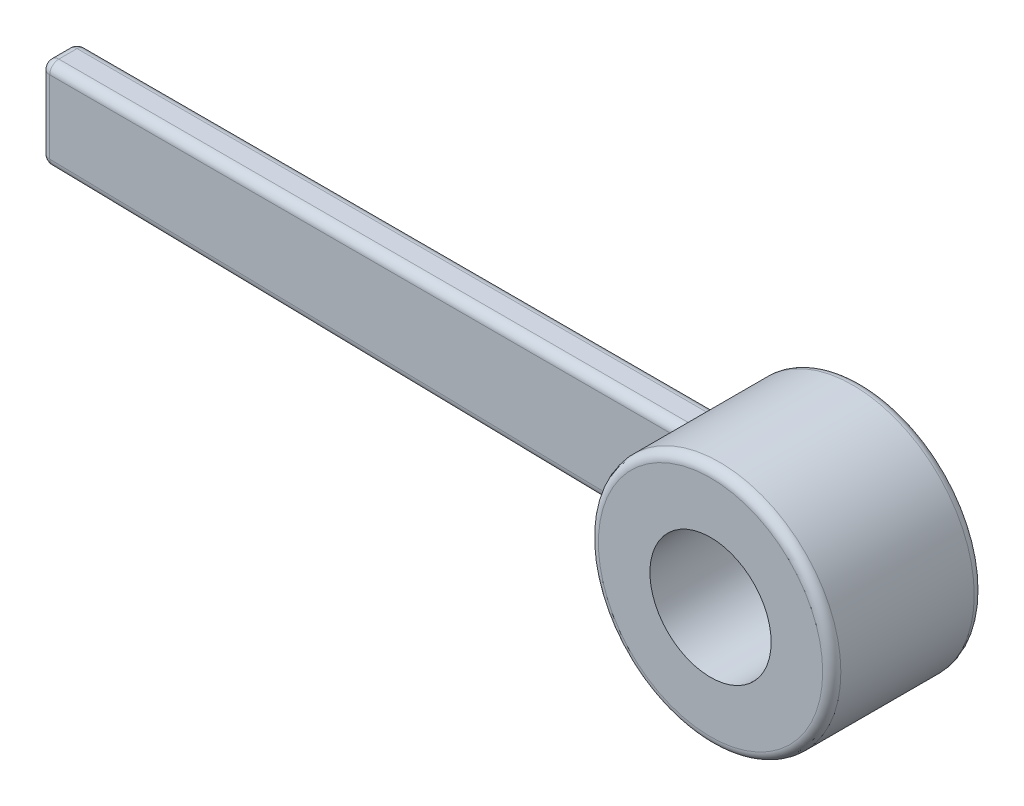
ISO-10303-21;
HEADER;
FILE_DESCRIPTION(('STEP AP214'),'2;1');
FILE_NAME('part.step','',(''),(''),'','','');
FILE_SCHEMA(('AUTOMOTIVE_DESIGN { 1 0 10303 214 1 1 1 1 }'));
ENDSEC;
DATA;
#1=APPLICATION_CONTEXT('core data for automotive mechanical design processes');
#2=APPLICATION_PROTOCOL_DEFINITION('international standard','automotive_design',2000,#1);
#3=PRODUCT_CONTEXT('',#1,'mechanical');
#4=PRODUCT('Part','Part','',(#3));
#5=PRODUCT_RELATED_PRODUCT_CATEGORY('part','',(#4));
#6=PRODUCT_DEFINITION_FORMATION('','',#4);
#7=PRODUCT_DEFINITION_CONTEXT('part definition',#1,'design');
#8=PRODUCT_DEFINITION('design','',#6,#7);
#9=PRODUCT_DEFINITION_SHAPE('','',#8);
#10=(LENGTH_UNIT() NAMED_UNIT(*) SI_UNIT(.MILLI.,.METRE.));
#11=(NAMED_UNIT(*) PLANE_ANGLE_UNIT() SI_UNIT($,.RADIAN.));
#12=(NAMED_UNIT(*) SI_UNIT($,.STERADIAN.) SOLID_ANGLE_UNIT());
#13=UNCERTAINTY_MEASURE_WITH_UNIT(LENGTH_MEASURE(1.E-05),#10,'distance_accuracy_value','');
#14=(GEOMETRIC_REPRESENTATION_CONTEXT(3) GLOBAL_UNCERTAINTY_ASSIGNED_CONTEXT((#13)) GLOBAL_UNIT_ASSIGNED_CONTEXT((#10,
#11,#12)) REPRESENTATION_CONTEXT('',''));
#15=CARTESIAN_POINT('',(0.,0.,0.));
#16=DIRECTION('',(0.,0.,1.));
#17=DIRECTION('',(1.,0.,0.));
#18=AXIS2_PLACEMENT_3D('',#15,#16,#17);
#19=CARTESIAN_POINT('',(0.,0.,25.));
#20=DIRECTION('',(0.,0.,-1.));
#21=DIRECTION('',(-1.,0.,0.));
#22=AXIS2_PLACEMENT_3D('',#19,#20,#21);
#23=CYLINDRICAL_SURFACE('',#22,40.);
#24=CARTESIAN_POINT('',(0.,0.,-22.));
#25=DIRECTION('',(0.,0.,1.));
#26=DIRECTION('',(1.,0.,0.));
#27=AXIS2_PLACEMENT_3D('',#24,#25,#26);
#28=CIRCLE('',#27,40.);
#29=CARTESIAN_POINT('',(40.,0.,-22.));
#30=VERTEX_POINT('',#29);
#31=EDGE_CURVE('E292',#30,#30,#28,.T.);
#32=ORIENTED_EDGE('',*,*,#31,.T.);
#33=EDGE_LOOP('',(#32));
#34=FACE_BOUND('',#33,.T.);
#35=CARTESIAN_POINT('',(0.,0.,22.));
#36=DIRECTION('',(0.,0.,1.));
#37=DIRECTION('',(1.,0.,0.));
#38=AXIS2_PLACEMENT_3D('',#35,#36,#37);
#39=CIRCLE('',#38,40.);
#40=CARTESIAN_POINT('',(40.,0.,22.));
#41=VERTEX_POINT('',#40);
#42=EDGE_CURVE('E289',#41,#41,#39,.F.);
#43=ORIENTED_EDGE('',*,*,#42,.T.);
#44=EDGE_LOOP('',(#43));
#45=FACE_BOUND('',#44,.T.);
#46=CARTESIAN_POINT('',(-38.3919970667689,11.2274022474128,-18.6303653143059));
#47=CARTESIAN_POINT('',(-38.0827090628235,12.2850096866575,-15.5127924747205));
#48=CARTESIAN_POINT('',(-41.2713968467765,13.106157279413,-15.815182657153));
#49=CARTESIAN_POINT('',(-38.346418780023,11.3832945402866,-18.6920979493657));
#50=CARTESIAN_POINT('',(-38.0604944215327,12.3450549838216,-15.5625338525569));
#51=CARTESIAN_POINT('',(-41.2224001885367,13.1899493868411,-15.8460489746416));
#52=CARTESIAN_POINT('',(-38.2991691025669,11.5413033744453,-18.7461335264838));
#53=CARTESIAN_POINT('',(-38.0374676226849,12.4083871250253,-15.6107902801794));
#54=CARTESIAN_POINT('',(-41.171606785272,13.274879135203,-15.8730667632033));
#55=CARTESIAN_POINT('',(-38.2016098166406,11.8602099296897,-18.8387191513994));
#56=CARTESIAN_POINT('',(-37.9897217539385,12.5414066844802,-15.7029615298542));
#57=CARTESIAN_POINT('',(-41.0667305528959,13.4462914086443,-15.9193595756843));
#58=CARTESIAN_POINT('',(-38.1513013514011,12.0211065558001,-18.8772749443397));
#59=CARTESIAN_POINT('',(-37.9650354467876,12.6109893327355,-15.7468756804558));
#60=CARTESIAN_POINT('',(-41.0126489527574,13.5327733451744,-15.9386374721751));
#61=CARTESIAN_POINT('',(-38.0479851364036,12.3442118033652,-18.9387888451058));
#62=CARTESIAN_POINT('',(-37.9138526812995,12.7563950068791,-15.8293529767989));
#63=CARTESIAN_POINT('',(-40.9015840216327,13.7064424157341,-15.9693944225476));
#64=CARTESIAN_POINT('',(-37.9949834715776,12.5064168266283,-18.9617805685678));
#65=CARTESIAN_POINT('',(-37.8873947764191,12.8320968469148,-15.8679417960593));
#66=CARTESIAN_POINT('',(-40.8446072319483,13.7936276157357,-15.9808902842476));
#67=CARTESIAN_POINT('',(-37.8865284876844,12.831225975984,-18.9923912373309));
#68=CARTESIAN_POINT('',(-37.8325114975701,12.989556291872,-15.9388322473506));
#69=CARTESIAN_POINT('',(-40.7280181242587,13.9682125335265,-15.996195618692));
#70=CARTESIAN_POINT('',(-37.8310749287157,12.9938301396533,-19.000008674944));
#71=CARTESIAN_POINT('',(-37.804120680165,13.071211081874,-15.9711681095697));
#72=CARTESIAN_POINT('',(-40.6684055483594,14.055612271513,-16.0000043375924));
#73=CARTESIAN_POINT('',(-37.6574749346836,13.4922424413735,-18.9999820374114));
#74=CARTESIAN_POINT('',(-37.7141779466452,13.3294576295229,-16.058831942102));
#75=CARTESIAN_POINT('',(-40.4817855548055,14.3235088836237,-15.9999910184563));
#76=CARTESIAN_POINT('',(-37.5357711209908,13.8271033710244,-18.9672670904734));
#77=CARTESIAN_POINT('',(-37.6489460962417,13.5161785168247,-16.1029968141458));
#78=CARTESIAN_POINT('',(-40.3509539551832,14.5034966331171,-15.9836335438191));
#79=CARTESIAN_POINT('',(-37.2871962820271,14.4840878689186,-18.8387732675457));
#80=CARTESIAN_POINT('',(-37.5099033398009,13.9070726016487,-16.1513008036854));
#81=CARTESIAN_POINT('',(-40.0837360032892,14.8566258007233,-15.9193866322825));
#82=CARTESIAN_POINT('',(-37.1603227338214,14.8062050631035,-18.7429632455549));
#83=CARTESIAN_POINT('',(-37.4363489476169,14.110658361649,-16.1562133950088));
#84=CARTESIAN_POINT('',(-39.9473469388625,15.02976379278,-15.8714816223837));
#85=CARTESIAN_POINT('',(-36.9060483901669,15.4290834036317,-18.4915838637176));
#86=CARTESIAN_POINT('',(-37.2829486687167,14.5247748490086,-16.1200578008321));
#87=CARTESIAN_POINT('',(-39.6740020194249,15.3645609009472,-15.7457919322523));
#88=CARTESIAN_POINT('',(-36.7786480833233,15.7298610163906,-18.3360611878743));
#89=CARTESIAN_POINT('',(-37.2032559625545,14.7351063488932,-16.0799755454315));
#90=CARTESIAN_POINT('',(-39.5370466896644,15.5262288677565,-15.6680305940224));
#91=CARTESIAN_POINT('',(-36.5284663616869,16.3024191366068,-17.9687901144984));
#92=CARTESIAN_POINT('',(-37.0414879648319,15.1509145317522,-15.9509136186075));
#93=CARTESIAN_POINT('',(-39.2681013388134,15.8339788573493,-15.4843950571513));
#94=CARTESIAN_POINT('',(-36.4056860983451,16.5741924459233,-17.7570278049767));
#95=CARTESIAN_POINT('',(-36.9593935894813,15.3566538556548,-15.8628330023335));
#96=CARTESIAN_POINT('',(-39.1361125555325,15.9800570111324,-15.3785139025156));
#97=CARTESIAN_POINT('',(-36.1706769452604,17.0809933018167,-17.2812748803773));
#98=CARTESIAN_POINT('',(-36.7982524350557,15.7507075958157,-15.6378900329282));
#99=CARTESIAN_POINT('',(-38.8834777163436,16.252462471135,-15.1406374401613));
#100=CARTESIAN_POINT('',(-36.0584624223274,17.3159710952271,-17.0172146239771));
#101=CARTESIAN_POINT('',(-36.7190071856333,15.9396730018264,-15.5016316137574));
#102=CARTESIAN_POINT('',(-38.7628471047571,16.3787630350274,-15.008607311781));
#103=CARTESIAN_POINT('',(-35.8516495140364,17.7402095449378,-16.4424112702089));
#104=CARTESIAN_POINT('',(-36.5704226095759,16.2868097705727,-15.1837417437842));
#105=CARTESIAN_POINT('',(-38.5405232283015,16.6067912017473,-14.7212056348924));
#106=CARTESIAN_POINT('',(-35.7570373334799,17.9295060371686,-16.1317050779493));
#107=CARTESIAN_POINT('',(-36.5007224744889,16.4459467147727,-15.0024052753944));
#108=CARTESIAN_POINT('',(-38.4388151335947,16.7085380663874,-14.5658525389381));
#109=CARTESIAN_POINT('',(-35.636921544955,18.1663675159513,-15.6497294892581));
#110=CARTESIAN_POINT('',(-36.4111043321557,16.6475685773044,-14.7091460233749));
#111=CARTESIAN_POINT('',(-38.3096906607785,16.8358511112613,-14.324864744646));
#112=CARTESIAN_POINT('',(-35.6015800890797,18.2354735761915,-15.4931221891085));
#113=CARTESIAN_POINT('',(-36.3846085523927,16.7066881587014,-14.6125912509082));
#114=CARTESIAN_POINT('',(-38.271698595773,16.8729956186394,-14.2465610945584));
#115=CARTESIAN_POINT('',(-35.5369056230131,18.3611908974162,-15.1728714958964));
#116=CARTESIAN_POINT('',(-36.3359218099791,16.8146852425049,-14.4125988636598));
#117=CARTESIAN_POINT('',(-38.2021735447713,16.9405686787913,-14.0864357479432));
#118=CARTESIAN_POINT('',(-35.507569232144,18.4178091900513,-15.0092321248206));
#119=CARTESIAN_POINT('',(-36.3136874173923,16.8636626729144,-14.3091101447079));
#120=CARTESIAN_POINT('',(-38.1706369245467,16.9710010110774,-14.004616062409));
#121=CARTESIAN_POINT('',(-35.4555348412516,18.5177815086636,-14.6762197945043));
#122=CARTESIAN_POINT('',(-36.2741391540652,16.9503836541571,-14.0965141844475));
#123=CARTESIAN_POINT('',(-38.1146999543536,17.024736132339,-13.8381098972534));
#124=CARTESIAN_POINT('',(-35.4328345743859,18.561140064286,-14.5068488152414));
#125=CARTESIAN_POINT('',(-36.2567867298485,16.9882135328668,-13.9873287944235));
#126=CARTESIAN_POINT('',(-38.0902971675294,17.0480413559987,-13.7534244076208));
#127=CARTESIAN_POINT('',(-35.3945871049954,18.6339716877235,-14.1638584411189));
#128=CARTESIAN_POINT('',(-36.2275067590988,17.0518504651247,-13.7648222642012));
#129=CARTESIAN_POINT('',(-38.0491811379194,17.0871883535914,-13.5819292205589));
#130=CARTESIAN_POINT('',(-35.3790358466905,18.663452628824,-13.9902415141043));
#131=CARTESIAN_POINT('',(-36.2155468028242,17.0777287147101,-13.6514025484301));
#132=CARTESIAN_POINT('',(-38.03246353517,17.1030343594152,-13.495120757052));
#133=CARTESIAN_POINT('',(-35.3567767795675,18.7055829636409,-13.6600377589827));
#134=CARTESIAN_POINT('',(-36.1984224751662,17.11472208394,-13.4349165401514));
#135=CARTESIAN_POINT('',(-38.008535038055,17.1256794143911,-13.3300188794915));
#136=CARTESIAN_POINT('',(-35.3492702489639,18.7197540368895,-13.5037350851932));
#137=CARTESIAN_POINT('',(-36.1926315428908,17.1271996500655,-13.3320539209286));
#138=CARTESIAN_POINT('',(-38.00046551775,17.1332963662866,-13.2518675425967));
#139=CARTESIAN_POINT('',(-35.3403185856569,18.7366476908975,-13.1902209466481));
#140=CARTESIAN_POINT('',(-36.1857294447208,17.1420664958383,-13.1255125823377));
#141=CARTESIAN_POINT('',(-37.9908424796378,17.1423767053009,-13.095110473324));
#142=CARTESIAN_POINT('',(-35.3388729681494,18.7393711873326,-13.0330095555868));
#143=CARTESIAN_POINT('',(-36.1846120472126,17.1444692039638,-13.0217468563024));
#144=CARTESIAN_POINT('',(-37.9892884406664,17.1438405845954,-13.0165047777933));
#145=CARTESIAN_POINT('',(-35.3420842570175,18.7333160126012,-12.7183811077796));
#146=CARTESIAN_POINT('',(-36.1870905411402,17.1391351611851,-12.81427894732));
#147=CARTESIAN_POINT('',(-37.9927405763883,17.1405859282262,-12.8591905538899));
#148=CARTESIAN_POINT('',(-35.3467620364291,18.724497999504,-12.5609651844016));
#149=CARTESIAN_POINT('',(-36.1907046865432,17.1313591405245,-12.7104892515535));
#150=CARTESIAN_POINT('',(-37.9977691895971,17.1358462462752,-12.780482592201));
#151=CARTESIAN_POINT('',(-35.362138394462,18.6954351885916,-12.2476693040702));
#152=CARTESIAN_POINT('',(-36.2025426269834,17.1058217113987,-12.5045220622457));
#153=CARTESIAN_POINT('',(-38.0142987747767,17.1202249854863,-12.6238346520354));
#154=CARTESIAN_POINT('',(-35.3728380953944,18.6751882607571,-12.0917896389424));
#155=CARTESIAN_POINT('',(-36.2107772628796,17.0880368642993,-12.4022595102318));
#156=CARTESIAN_POINT('',(-38.0258009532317,17.109342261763,-12.5458948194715));
#157=CARTESIAN_POINT('',(-35.3864888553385,18.6493004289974,-11.937309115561));
#158=CARTESIAN_POINT('',(-36.2212577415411,17.0653514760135,-12.3015283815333));
#159=CARTESIAN_POINT('',(-38.0404755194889,17.0954275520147,-12.4686545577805));
#160=(BOUNDED_SURFACE() B_SPLINE_SURFACE(3,2,((#46,#47,#48),(#49,#50,#51),(#52,#53,#54),(#55,
#56,#57),(#58,#59,#60),(#61,#62,#63),(#64,#65,#66),(#67,#68,#69),(#70,#71,#72),(#73,#74,#75),
(#76,#77,#78),(#79,#80,#81),(#82,#83,#84),(#85,#86,#87),(#88,#89,#90),(#91,#92,#93),(#94,#95,
#96),(#97,#98,#99),(#100,#101,#102),(#103,#104,#105),(#106,#107,#108),(#109,#110,#111),(#112,
#113,#114),(#115,#116,#117),(#118,#119,#120),(#121,#122,#123),(#124,#125,#126),(#127,#128,#129),
(#130,#131,#132),(#133,#134,#135),(#136,#137,#138),(#139,#140,#141),(#142,#143,#144),(#145,#146,
#147),(#148,#149,#150),(#151,#152,#153),(#154,#155,#156),(#157,#158,#159)),.UNSPECIFIED.,.F.,
.F.,.F.) B_SPLINE_SURFACE_WITH_KNOTS((4,2,2,2,2,2,2,2,2,2,2,2,2,2,2,2,2,2,4),(3,3),(0.,
0.555346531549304,1.11048676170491,1.66442412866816,2.21841581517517,3.36552694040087,
4.5132047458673,5.65998710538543,6.80705340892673,7.95565757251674,9.10335773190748,
9.63508797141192,10.1665180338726,10.6977663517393,11.2287129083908,11.6998629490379,
12.1709753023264,12.6436977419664,13.1165083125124),(0.,1.),
.UNSPECIFIED.) GEOMETRIC_REPRESENTATION_ITEM() RATIONAL_B_SPLINE_SURFACE(((1.,0.67193921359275,
1.),(1.,0.674353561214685,1.),(1.,0.676911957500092,1.),(1.,0.682296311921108,1.),(1.,
0.685122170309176,1.),(1.,0.691016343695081,1.),(1.,0.694084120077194,1.),(1.,0.700438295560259,
1.),(1.,0.703724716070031,1.),(1.,0.714109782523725,1.),(1.,0.721522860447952,1.),(1.,
0.73681205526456,1.),(1.,0.744688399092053,1.),(1.,0.760517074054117,1.),(1.,0.768469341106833,
1.),(1.,0.784059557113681,1.),(1.,0.791697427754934,1.),(1.,0.806257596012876,1.),(1.,
0.813178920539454,1.),(1.,0.825873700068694,1.),(1.,0.831648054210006,1.),(1.,0.838948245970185,
1.),(1.,0.84109097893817,1.),(1.,0.845005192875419,1.),(1.,0.846776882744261,1.),(1.,
0.849914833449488,1.),(1.,0.851281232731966,1.),(1.,0.853581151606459,1.),(1.,0.854514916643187,
1.),(1.,0.855850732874,1.),(1.,0.85630082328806,1.),(1.,0.856837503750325,1.),(1.,
0.856924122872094,1.),(1.,0.856731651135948,1.),(1.,0.856451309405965,1.),(1.,0.855528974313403,
1.),(1.,0.854886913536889,1.),(1.,0.854067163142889,1.))) REPRESENTATION_ITEM('') SURFACE());
#161=CARTESIAN_POINT('',(-35.3864888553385,18.6493004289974,-11.937309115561));
#162=CARTESIAN_POINT('',(-35.3728380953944,18.6751882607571,-12.0917896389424));
#163=CARTESIAN_POINT('',(-35.362138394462,18.6954351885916,-12.2476693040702));
#164=CARTESIAN_POINT('',(-35.3467620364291,18.724497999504,-12.5609651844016));
#165=CARTESIAN_POINT('',(-35.3420842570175,18.7333160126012,-12.7183811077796));
#166=CARTESIAN_POINT('',(-35.3388729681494,18.7393711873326,-13.0330095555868));
#167=CARTESIAN_POINT('',(-35.3403185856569,18.7366476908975,-13.1902209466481));
#168=CARTESIAN_POINT('',(-35.3492702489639,18.7197540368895,-13.5037350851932));
#169=CARTESIAN_POINT('',(-35.3567767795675,18.7055829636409,-13.6600377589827));
#170=CARTESIAN_POINT('',(-35.3790358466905,18.663452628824,-13.9902415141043));
#171=CARTESIAN_POINT('',(-35.3945871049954,18.6339716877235,-14.1638584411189));
#172=CARTESIAN_POINT('',(-35.4328345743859,18.561140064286,-14.5068488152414));
#173=CARTESIAN_POINT('',(-35.4555348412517,18.5177815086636,-14.6762197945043));
#174=CARTESIAN_POINT('',(-35.507569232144,18.4178091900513,-15.0092321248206));
#175=CARTESIAN_POINT('',(-35.5369056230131,18.3611908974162,-15.1728714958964));
#176=CARTESIAN_POINT('',(-35.6015800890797,18.2354735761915,-15.4931221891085));
#177=CARTESIAN_POINT('',(-35.636921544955,18.1663675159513,-15.6497294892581));
#178=CARTESIAN_POINT('',(-35.7570373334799,17.9295060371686,-16.1317050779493));
#179=CARTESIAN_POINT('',(-35.8516495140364,17.7402095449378,-16.4424112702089));
#180=CARTESIAN_POINT('',(-36.0584624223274,17.3159710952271,-17.0172146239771));
#181=CARTESIAN_POINT('',(-36.1706769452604,17.0809933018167,-17.2812748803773));
#182=CARTESIAN_POINT('',(-36.4056860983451,16.5741924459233,-17.7570278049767));
#183=CARTESIAN_POINT('',(-36.5284663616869,16.3024191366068,-17.9687901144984));
#184=CARTESIAN_POINT('',(-36.7786480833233,15.7298610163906,-18.3360611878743));
#185=CARTESIAN_POINT('',(-36.9060483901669,15.4290834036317,-18.4915838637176));
#186=CARTESIAN_POINT('',(-37.1603227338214,14.8062050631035,-18.7429632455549));
#187=CARTESIAN_POINT('',(-37.2871962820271,14.4840878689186,-18.8387732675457));
#188=CARTESIAN_POINT('',(-37.5357711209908,13.8271033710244,-18.9672670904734));
#189=CARTESIAN_POINT('',(-37.6574749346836,13.4922424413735,-18.9999820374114));
#190=CARTESIAN_POINT('',(-37.8310749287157,12.9938301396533,-19.000008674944));
#191=CARTESIAN_POINT('',(-37.8865284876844,12.831225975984,-18.9923912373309));
#192=CARTESIAN_POINT('',(-37.9949834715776,12.5064168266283,-18.9617805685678));
#193=CARTESIAN_POINT('',(-38.0479851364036,12.3442118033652,-18.9387888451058));
#194=CARTESIAN_POINT('',(-38.1513013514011,12.0211065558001,-18.8772749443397));
#195=CARTESIAN_POINT('',(-38.2016098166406,11.8602099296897,-18.8387191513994));
#196=CARTESIAN_POINT('',(-38.2991691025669,11.5413033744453,-18.7461335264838));
#197=CARTESIAN_POINT('',(-38.346418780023,11.3832945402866,-18.6920979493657));
#198=CARTESIAN_POINT('',(-38.3919970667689,11.2274022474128,-18.6303653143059));
#199=B_SPLINE_CURVE_WITH_KNOTS('',3,(#161,#162,#163,#164,#165,#166,#167,#168,#169,#170,#171,
#172,#173,#174,#175,#176,#177,#178,#179,#180,#181,#182,#183,#184,#185,#186,#187,#188,#189,#190,
#191,#192,#193,#194,#195,#196,#197,#198),.UNSPECIFIED.,.F.,.F.,(4,2,2,2,2,2,2,2,2,2,2,2,2,2,2,2,
2,2,4),(0.,0.472810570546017,0.945533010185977,1.4166453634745,1.88779540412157,
2.41874196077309,2.94999027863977,3.48142034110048,4.01315058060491,5.16085073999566,
6.30945490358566,7.45652120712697,8.6033035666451,9.75098137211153,10.8980924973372,
11.4520841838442,12.0060215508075,12.5611617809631,13.1165083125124),.UNSPECIFIED.);
#200=CARTESIAN_POINT('',(-35.3398434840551,18.7375415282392,-13.));
#201=VERTEX_POINT('',#200);
#202=CARTESIAN_POINT('',(-37.7745392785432,13.156146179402,-19.));
#203=VERTEX_POINT('',#202);
#204=EDGE_CURVE('E54',#201,#203,#199,.T.);
#205=ORIENTED_EDGE('',*,*,#204,.F.);
#206=DIRECTION('',(0.,0.,-1.));
#207=VECTOR('',#206,1.);
#208=CARTESIAN_POINT('',(-35.3398434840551,18.7375415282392,25.));
#209=LINE('',#208,#207);
#210=CARTESIAN_POINT('',(-35.3398434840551,18.7375415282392,-7.));
#211=VERTEX_POINT('',#210);
#212=EDGE_CURVE('E49',#201,#211,#209,.F.);
#213=ORIENTED_EDGE('',*,*,#212,.T.);
#214=CARTESIAN_POINT('',(-35.4720239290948,18.4860898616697,-8.78063435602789));
#215=CARTESIAN_POINT('',(-36.2866311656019,16.922981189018,-8.16292968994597));
#216=CARTESIAN_POINT('',(-38.1324257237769,17.007701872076,-7.89031717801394));
#217=CARTESIAN_POINT('',(-35.4504893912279,18.5274021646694,-8.63779622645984));
#218=CARTESIAN_POINT('',(-36.270265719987,16.9588152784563,-8.07168564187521));
#219=CARTESIAN_POINT('',(-38.109276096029,17.0299072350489,-7.81889811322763));
#220=CARTESIAN_POINT('',(-35.4314195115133,18.5638270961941,-8.49288335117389));
#221=CARTESIAN_POINT('',(-36.255695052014,16.9905799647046,-7.97820510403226));
#222=CARTESIAN_POINT('',(-38.0887759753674,17.0494856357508,-7.74644167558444));
#223=CARTESIAN_POINT('',(-35.3984710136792,18.626583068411,-8.19986808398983));
#224=CARTESIAN_POINT('',(-36.2304781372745,17.0453983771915,-7.78816518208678));
#225=CARTESIAN_POINT('',(-38.0533563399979,17.0832169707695,-7.59993404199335));
#226=CARTESIAN_POINT('',(-35.3845930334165,18.6529128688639,-8.05176530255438));
#227=CARTESIAN_POINT('',(-36.2198139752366,17.0684914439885,-7.69154253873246));
#228=CARTESIAN_POINT('',(-38.038437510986,17.0973692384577,-7.52588265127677));
#229=CARTESIAN_POINT('',(-35.3623122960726,18.6951176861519,-7.75358787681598));
#230=CARTESIAN_POINT('',(-36.2026852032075,17.1055239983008,-7.49634181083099));
#231=CARTESIAN_POINT('',(-38.0144857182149,17.1200543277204,-7.37679393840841));
#232=CARTESIAN_POINT('',(-35.3539014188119,18.711008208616,-7.60351649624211));
#233=CARTESIAN_POINT('',(-36.1962013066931,17.1195054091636,-7.39769565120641));
#234=CARTESIAN_POINT('',(-38.0054440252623,17.1285954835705,-7.30175824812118));
#235=CARTESIAN_POINT('',(-35.3426633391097,18.7322252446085,-7.30232427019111));
#236=CARTESIAN_POINT('',(-36.187538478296,17.1381721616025,-7.19942184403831));
#237=CARTESIAN_POINT('',(-37.9933630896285,17.1399996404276,-7.15116213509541));
#238=CARTESIAN_POINT('',(-35.3398357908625,18.7375524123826,-7.15120349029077));
#239=CARTESIAN_POINT('',(-36.1853525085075,17.1428726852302,-7.09971752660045));
#240=CARTESIAN_POINT('',(-37.9903234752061,17.1428629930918,-7.07560174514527));
#241=CARTESIAN_POINT('',(-35.3398593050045,18.7375191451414,-6.68905201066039));
#242=CARTESIAN_POINT('',(-36.1853791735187,17.1428251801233,-6.79493190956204));
#243=CARTESIAN_POINT('',(-37.9903487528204,17.1428451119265,-6.84452600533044));
#244=CARTESIAN_POINT('',(-35.3518657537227,18.7149214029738,-6.37775422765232));
#245=CARTESIAN_POINT('',(-36.1946847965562,17.1228354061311,-6.58929649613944));
#246=CARTESIAN_POINT('',(-38.0032556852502,17.1306988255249,-6.68887711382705));
#247=CARTESIAN_POINT('',(-35.3989770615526,18.6256495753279,-5.76496220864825));
#248=CARTESIAN_POINT('',(-36.2308875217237,17.044534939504,-6.18831944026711));
#249=CARTESIAN_POINT('',(-38.0539003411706,17.0827152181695,-6.38248110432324));
#250=CARTESIAN_POINT('',(-35.4340774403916,18.5589840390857,-5.46346608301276));
#251=CARTESIAN_POINT('',(-36.2578987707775,16.9859765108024,-5.9923550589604));
#252=CARTESIAN_POINT('',(-38.0916332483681,17.0468824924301,-6.23173304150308));
#253=CARTESIAN_POINT('',(-35.5246560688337,18.3850024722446,-4.87916709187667));
#254=CARTESIAN_POINT('',(-36.3267540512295,16.8350281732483,-5.61914707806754));
#255=CARTESIAN_POINT('',(-38.1890052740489,16.9533674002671,-5.93958354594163));
#256=CARTESIAN_POINT('',(-35.5800747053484,18.2778053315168,-4.59631236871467));
#257=CARTESIAN_POINT('',(-36.3687532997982,16.7422933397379,-5.44141279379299));
#258=CARTESIAN_POINT('',(-38.2485803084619,16.8957489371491,-5.7981561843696));
#259=CARTESIAN_POINT('',(-35.7078208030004,18.026959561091,-4.05472388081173));
#260=CARTESIAN_POINT('',(-36.4641047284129,16.5286670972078,-5.10996940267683));
#261=CARTESIAN_POINT('',(-38.3859073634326,16.760919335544,-5.5273619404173));
#262=CARTESIAN_POINT('',(-35.7801572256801,17.8832916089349,-3.79600300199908));
#263=CARTESIAN_POINT('',(-36.5176897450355,16.4072271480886,-4.95607830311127));
#264=CARTESIAN_POINT('',(-38.4636690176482,16.6836978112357,-5.39800150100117));
#265=CARTESIAN_POINT('',(-35.9422620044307,17.5553125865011,-3.2939487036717));
#266=CARTESIAN_POINT('',(-36.6356327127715,16.1352428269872,-4.66855983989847));
#267=CARTESIAN_POINT('',(-38.6379316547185,16.5074090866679,-5.14697435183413));
#268=CARTESIAN_POINT('',(-36.0327752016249,17.3691878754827,-3.05226707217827));
#269=CARTESIAN_POINT('',(-36.7006211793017,15.9829433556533,-4.53668275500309));
#270=CARTESIAN_POINT('',(-38.7352333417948,16.4073670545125,-5.0261335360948));
#271=CARTESIAN_POINT('',(-36.2239144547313,16.9669563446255,-2.6051720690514));
#272=CARTESIAN_POINT('',(-36.8347595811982,15.6620526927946,-4.30688622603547));
#273=CARTESIAN_POINT('',(-38.9407080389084,16.1911676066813,-4.80258603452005));
#274=CARTESIAN_POINT('',(-36.3245432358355,16.7508414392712,-2.39976851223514));
#275=CARTESIAN_POINT('',(-36.9040847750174,15.4929466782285,-4.20928618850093));
#276=CARTESIAN_POINT('',(-39.048883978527,16.0750058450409,-4.69988425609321));
#277=CARTESIAN_POINT('',(-36.5428450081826,16.2695220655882,-2.00856908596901));
#278=CARTESIAN_POINT('',(-37.0507012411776,15.1274451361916,-4.04028870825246));
#279=CARTESIAN_POINT('',(-39.283558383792,15.8162966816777,-4.50428454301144));
#280=CARTESIAN_POINT('',(-36.6611949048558,16.001543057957,-1.82714647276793));
#281=CARTESIAN_POINT('',(-37.1280257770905,14.9299798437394,-3.97355216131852));
#282=CARTESIAN_POINT('',(-39.4107845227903,15.6722579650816,-4.41357323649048));
#283=CARTESIAN_POINT('',(-36.9004423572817,15.4418270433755,-1.51570791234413));
#284=CARTESIAN_POINT('',(-37.2793100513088,14.5344783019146,-3.88160440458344));
#285=CARTESIAN_POINT('',(-39.6679755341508,15.3714106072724,-4.25785395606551));
#286=CARTESIAN_POINT('',(-37.0213410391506,15.1500793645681,-1.38571521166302));
#287=CARTESIAN_POINT('',(-37.3532326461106,14.336349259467,-3.85721610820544));
#288=CARTESIAN_POINT('',(-39.7979416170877,15.2145962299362,-4.19285760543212));
#289=CARTESIAN_POINT('',(-37.2686513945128,14.5315209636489,-1.17393978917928));
#290=CARTESIAN_POINT('',(-37.499389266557,13.9366941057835,-3.84642861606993));
#291=CARTESIAN_POINT('',(-40.0638002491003,14.8821210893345,-4.08696989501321));
#292=CARTESIAN_POINT('',(-37.3949537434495,14.2036568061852,-1.09555196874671));
#293=CARTESIAN_POINT('',(-37.5709743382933,13.7362530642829,-3.86333468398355));
#294=CARTESIAN_POINT('',(-40.1995752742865,14.705894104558,-4.04777598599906));
#295=CARTESIAN_POINT('',(-37.6411451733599,13.5377177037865,-1.00319198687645));
#296=CARTESIAN_POINT('',(-37.7057436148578,13.3541008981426,-3.93382938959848));
#297=CARTESIAN_POINT('',(-40.4642310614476,14.3479518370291,-4.00159599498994));
#298=CARTESIAN_POINT('',(-37.7610372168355,13.1996475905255,-0.989189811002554));
#299=CARTESIAN_POINT('',(-37.7686463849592,13.1730820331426,-3.98812418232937));
#300=CARTESIAN_POINT('',(-40.5931150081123,14.1662391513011,-3.99459490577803));
#301=CARTESIAN_POINT('',(-37.9325337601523,12.6946593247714,-1.01782805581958));
#302=CARTESIAN_POINT('',(-37.8559437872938,12.9222905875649,-4.08984557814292));
#303=CARTESIAN_POINT('',(-40.7774737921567,13.8948079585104,-4.00891402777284));
#304=CARTESIAN_POINT('',(-37.9880394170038,12.5275534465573,-1.0354279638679));
#305=CARTESIAN_POINT('',(-37.883891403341,12.8420795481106,-4.12720181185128));
#306=CARTESIAN_POINT('',(-40.8371423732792,13.8049885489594,-4.01771398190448));
#307=CARTESIAN_POINT('',(-38.0962336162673,12.1945701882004,-1.08695256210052));
#308=CARTESIAN_POINT('',(-37.9378559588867,12.6880417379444,-4.20782711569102));
#309=CARTESIAN_POINT('',(-40.953451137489,13.626010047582,-4.04347628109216));
#310=CARTESIAN_POINT('',(-38.14892237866,12.0286927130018,-1.12087597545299));
#311=CARTESIAN_POINT('',(-37.963835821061,12.6143286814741,-4.25112016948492));
#312=CARTESIAN_POINT('',(-41.0100915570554,13.5368509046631,-4.0604379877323));
#313=CARTESIAN_POINT('',(-38.2512768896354,11.6991296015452,-1.20517782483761));
#314=CARTESIAN_POINT('',(-38.0140816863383,12.4732674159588,-4.3426688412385));
#315=CARTESIAN_POINT('',(-41.1201226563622,13.3597107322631,-4.10258891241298));
#316=CARTESIAN_POINT('',(-38.300934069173,11.5354511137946,-1.25560055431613));
#317=CARTESIAN_POINT('',(-38.0383064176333,12.4060524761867,-4.39093984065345));
#318=CARTESIAN_POINT('',(-41.1735041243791,13.2717335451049,-4.12780027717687));
#319=CARTESIAN_POINT('',(-38.3968389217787,11.212111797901,-1.37271834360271));
#320=CARTESIAN_POINT('',(-38.0851527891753,12.2780338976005,-4.4914556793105));
#321=CARTESIAN_POINT('',(-41.2766018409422,13.0979386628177,-4.18635917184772));
#322=CARTESIAN_POINT('',(-38.4430852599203,11.052452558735,-1.43941973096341));
#323=CARTESIAN_POINT('',(-38.1077406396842,12.2173390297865,-4.54368801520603));
#324=CARTESIAN_POINT('',(-41.3263166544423,13.012121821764,-4.21970986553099));
#325=CARTESIAN_POINT('',(-38.4874911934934,10.8955505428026,-1.51416204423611));
#326=CARTESIAN_POINT('',(-38.1295446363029,12.1599625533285,-4.59721522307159));
#327=CARTESIAN_POINT('',(-41.3740530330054,12.927786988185,-4.25708102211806));
#328=(BOUNDED_SURFACE() B_SPLINE_SURFACE(3,2,((#214,#215,#216),(#217,#218,#219),(#220,#221,
#222),(#223,#224,#225),(#226,#227,#228),(#229,#230,#231),(#232,#233,#234),(#235,#236,#237),
(#238,#239,#240),(#241,#242,#243),(#244,#245,#246),(#247,#248,#249),(#250,#251,#252),(#253,#254,
#255),(#256,#257,#258),(#259,#260,#261),(#262,#263,#264),(#265,#266,#267),(#268,#269,#270),
(#271,#272,#273),(#274,#275,#276),(#277,#278,#279),(#280,#281,#282),(#283,#284,#285),(#286,#287,
#288),(#289,#290,#291),(#292,#293,#294),(#295,#296,#297),(#298,#299,#300),(#301,#302,#303),
(#304,#305,#306),(#307,#308,#309),(#310,#311,#312),(#313,#314,#315),(#316,#317,#318),(#319,#320,
#321),(#322,#323,#324),(#325,#326,#327)),.UNSPECIFIED.,.F.,.F.,
.F.) B_SPLINE_SURFACE_WITH_KNOTS((4,2,2,2,2,2,2,2,2,2,2,2,2,2,2,2,2,2,4),(3,3),(0.,
0.453978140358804,0.9080120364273,1.36137001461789,1.81469991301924,2.7469668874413,
3.67905305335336,4.6084261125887,5.53829259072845,6.51978476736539,7.50154207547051,
8.58716229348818,9.6732726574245,10.8251333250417,11.9764569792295,12.5461750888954,
13.1158486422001,13.6870642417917,14.2585022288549),(0.,1.),
.UNSPECIFIED.) GEOMETRIC_REPRESENTATION_ITEM() RATIONAL_B_SPLINE_SURFACE(((1.,0.848920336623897,
1.),(1.,0.850218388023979,1.),(1.,0.851366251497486,1.),(1.,0.853347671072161,1.),(1.,
0.854181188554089,1.),(1.,0.855518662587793,1.),(1.,0.856023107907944,1.),(1.,0.856696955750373,
1.),(1.,0.856866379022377,1.),(1.,0.856865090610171,1.),(1.,0.856145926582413,1.),(1.,
0.853317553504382,1.),(1.,0.851208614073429,1.),(1.,0.845746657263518,1.),(1.,0.84239727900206,
1.),(1.,0.834642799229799,1.),(1.,0.830237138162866,1.),(1.,0.820318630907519,1.),(1.,
0.814757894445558,1.),(1.,0.802963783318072,1.),(1.,0.796730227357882,1.),(1.,0.783166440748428,
1.),(1.,0.775789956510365,1.),(1.,0.760872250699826,1.),(1.,0.753330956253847,1.),(1.,
0.737967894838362,1.),(1.,0.730156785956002,1.),(1.,0.715107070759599,1.),(1.,0.707868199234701,
1.),(1.,0.697730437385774,1.),(1.,0.694486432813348,1.),(1.,0.688248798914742,1.),(1.,
0.685255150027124,1.),(1.,0.679537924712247,1.),(1.,0.676815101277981,1.),(1.,0.671663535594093,
1.),(1.,0.669234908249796,1.),(1.,0.666961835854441,1.))) REPRESENTATION_ITEM('') SURFACE());
#329=CARTESIAN_POINT('',(-38.4874911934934,10.8955505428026,-1.51416204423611));
#330=CARTESIAN_POINT('',(-38.4430852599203,11.052452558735,-1.43941973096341));
#331=CARTESIAN_POINT('',(-38.3968389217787,11.212111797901,-1.37271834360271));
#332=CARTESIAN_POINT('',(-38.300934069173,11.5354511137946,-1.25560055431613));
#333=CARTESIAN_POINT('',(-38.2512768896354,11.6991296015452,-1.20517782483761));
#334=CARTESIAN_POINT('',(-38.14892237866,12.0286927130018,-1.12087597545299));
#335=CARTESIAN_POINT('',(-38.0962336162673,12.1945701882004,-1.08695256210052));
#336=CARTESIAN_POINT('',(-37.9880394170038,12.5275534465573,-1.0354279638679));
#337=CARTESIAN_POINT('',(-37.9325337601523,12.6946593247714,-1.01782805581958));
#338=CARTESIAN_POINT('',(-37.7610372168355,13.1996475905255,-0.989189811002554));
#339=CARTESIAN_POINT('',(-37.6411451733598,13.5377177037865,-1.00319198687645));
#340=CARTESIAN_POINT('',(-37.3949537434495,14.2036568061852,-1.09555196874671));
#341=CARTESIAN_POINT('',(-37.2686513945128,14.5315209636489,-1.17393978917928));
#342=CARTESIAN_POINT('',(-37.0213410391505,15.1500793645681,-1.38571521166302));
#343=CARTESIAN_POINT('',(-36.9004423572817,15.4418270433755,-1.51570791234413));
#344=CARTESIAN_POINT('',(-36.6611949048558,16.001543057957,-1.82714647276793));
#345=CARTESIAN_POINT('',(-36.5428450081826,16.2695220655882,-2.00856908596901));
#346=CARTESIAN_POINT('',(-36.3245432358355,16.7508414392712,-2.39976851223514));
#347=CARTESIAN_POINT('',(-36.2239144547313,16.9669563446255,-2.6051720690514));
#348=CARTESIAN_POINT('',(-36.0327752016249,17.3691878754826,-3.05226707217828));
#349=CARTESIAN_POINT('',(-35.9422620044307,17.5553125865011,-3.2939487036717));
#350=CARTESIAN_POINT('',(-35.7801572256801,17.8832916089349,-3.79600300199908));
#351=CARTESIAN_POINT('',(-35.7078208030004,18.026959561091,-4.05472388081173));
#352=CARTESIAN_POINT('',(-35.5800747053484,18.2778053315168,-4.59631236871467));
#353=CARTESIAN_POINT('',(-35.5246560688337,18.3850024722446,-4.87916709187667));
#354=CARTESIAN_POINT('',(-35.4340774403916,18.5589840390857,-5.46346608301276));
#355=CARTESIAN_POINT('',(-35.3989770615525,18.6256495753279,-5.76496220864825));
#356=CARTESIAN_POINT('',(-35.3518657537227,18.7149214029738,-6.37775422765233));
#357=CARTESIAN_POINT('',(-35.3398593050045,18.7375191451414,-6.68905201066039));
#358=CARTESIAN_POINT('',(-35.3398357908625,18.7375524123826,-7.15120349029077));
#359=CARTESIAN_POINT('',(-35.3426633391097,18.7322252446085,-7.30232427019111));
#360=CARTESIAN_POINT('',(-35.3539014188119,18.711008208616,-7.60351649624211));
#361=CARTESIAN_POINT('',(-35.3623122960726,18.6951176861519,-7.75358787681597));
#362=CARTESIAN_POINT('',(-35.3845930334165,18.6529128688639,-8.05176530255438));
#363=CARTESIAN_POINT('',(-35.3984710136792,18.6265830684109,-8.19986808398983));
#364=CARTESIAN_POINT('',(-35.4314195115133,18.5638270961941,-8.49288335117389));
#365=CARTESIAN_POINT('',(-35.4504893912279,18.5274021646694,-8.63779622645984));
#366=CARTESIAN_POINT('',(-35.4720239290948,18.4860898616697,-8.78063435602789));
#367=B_SPLINE_CURVE_WITH_KNOTS('',3,(#329,#330,#331,#332,#333,#334,#335,#336,#337,#338,#339,
#340,#341,#342,#343,#344,#345,#346,#347,#348,#349,#350,#351,#352,#353,#354,#355,#356,#357,#358,
#359,#360,#361,#362,#363,#364,#365,#366),.UNSPECIFIED.,.F.,.F.,(4,2,2,2,2,2,2,2,2,2,2,2,2,2,2,2,
2,2,4),(0.,0.571437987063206,1.14265358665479,1.71232713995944,2.28204524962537,
3.43336890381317,4.58522957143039,5.67133993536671,6.75696015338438,7.7387174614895,
8.72020963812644,9.65007611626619,10.5794491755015,11.5115353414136,12.4438023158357,
12.897132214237,13.3504901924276,13.8045240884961,14.2585022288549),.UNSPECIFIED.);
#368=CARTESIAN_POINT('',(-37.7745392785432,13.156146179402,-1.));
#369=VERTEX_POINT('',#368);
#370=EDGE_CURVE('E278',#369,#211,#367,.T.);
#371=ORIENTED_EDGE('',*,*,#370,.F.);
#372=CARTESIAN_POINT('',(0.,0.,-1.));
#373=DIRECTION('',(0.,0.,-1.));
#374=DIRECTION('',(-1.,0.,0.));
#375=AXIS2_PLACEMENT_3D('',#372,#373,#374);
#376=CIRCLE('',#375,40.);
#377=CARTESIAN_POINT('',(-37.8038374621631,-13.071720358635,-1.));
#378=VERTEX_POINT('',#377);
#379=EDGE_CURVE('E279',#369,#378,#376,.F.);
#380=ORIENTED_EDGE('',*,*,#379,.T.);
#381=CARTESIAN_POINT('',(-38.4244203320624,-11.1159310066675,-1.37528715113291));
#382=CARTESIAN_POINT('',(-38.1153372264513,-12.1843380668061,-4.51205057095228));
#383=CARTESIAN_POINT('',(-41.3271761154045,-12.9937587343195,-4.18764357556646));
#384=CARTESIAN_POINT('',(-38.3787080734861,-11.2739841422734,-1.31255281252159));
#385=CARTESIAN_POINT('',(-38.0931051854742,-12.2447531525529,-4.46007922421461));
#386=CARTESIAN_POINT('',(-41.2763435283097,-13.0792385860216,-4.15627640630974));
#387=CARTESIAN_POINT('',(-38.3312900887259,-11.434202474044,-1.25766154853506));
#388=CARTESIAN_POINT('',(-38.0699974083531,-12.3087392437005,-4.4095483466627));
#389=CARTESIAN_POINT('',(-41.2236543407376,-13.1659010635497,-4.12883077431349));
#390=CARTESIAN_POINT('',(-38.2333292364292,-11.7575863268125,-1.16363829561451));
#391=CARTESIAN_POINT('',(-38.0219614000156,-12.4435769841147,-4.31289463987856));
#392=CARTESIAN_POINT('',(-41.1148856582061,-13.3408444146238,-4.08181914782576));
#393=CARTESIAN_POINT('',(-38.1827876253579,-11.9207506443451,-1.12450001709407));
#394=CARTESIAN_POINT('',(-37.9970685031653,-12.5143139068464,-4.26677145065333));
#395=CARTESIAN_POINT('',(-41.0588075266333,-13.429124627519,-4.06225000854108));
#396=CARTESIAN_POINT('',(-38.0789472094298,-12.2483991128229,-1.06207661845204));
#397=CARTESIAN_POINT('',(-37.9453371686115,-12.6624949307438,-4.18004389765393));
#398=CARTESIAN_POINT('',(-40.943673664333,-13.6064244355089,-4.03103830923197));
#399=CARTESIAN_POINT('',(-38.0256549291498,-12.4128794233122,-1.03875568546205));
#400=CARTESIAN_POINT('',(-37.9185404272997,-12.7398067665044,-4.1394101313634));
#401=CARTESIAN_POINT('',(-40.8846249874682,-13.6954418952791,-4.01937784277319));
#402=CARTESIAN_POINT('',(-37.9165581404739,-12.7422447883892,-1.00771221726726));
#403=CARTESIAN_POINT('',(-37.8628403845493,-12.900897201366,-4.06466492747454));
#404=CARTESIAN_POINT('',(-40.7638231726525,-13.8737215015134,-4.003856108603));
#405=CARTESIAN_POINT('',(-37.8607533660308,-12.9071298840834,-0.999991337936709));
#406=CARTESIAN_POINT('',(-37.8339741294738,-12.9845651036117,-4.03051442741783));
#407=CARTESIAN_POINT('',(-40.7020697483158,-13.9629836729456,-3.99999566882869));
#408=CARTESIAN_POINT('',(-37.6859636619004,-13.4125900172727,-1.0000179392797));
#409=CARTESIAN_POINT('',(-37.7423838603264,-13.2494442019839,-3.93777608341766));
#410=CARTESIAN_POINT('',(-40.508766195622,-14.2366595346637,-4.0000089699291));
#411=CARTESIAN_POINT('',(-37.5633241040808,-13.7521960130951,-1.03318874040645));
#412=CARTESIAN_POINT('',(-37.6757314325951,-13.4414270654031,-3.89074952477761));
#413=CARTESIAN_POINT('',(-40.3732985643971,-14.4205915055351,-4.01659437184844));
#414=CARTESIAN_POINT('',(-37.3126582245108,-14.4184850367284,-1.16337709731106));
#415=CARTESIAN_POINT('',(-37.5333508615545,-13.8436330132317,-3.83834204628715));
#416=CARTESIAN_POINT('',(-40.0967128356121,-14.7815645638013,-4.08168855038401));
#417=CARTESIAN_POINT('',(-37.1846290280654,-14.7451609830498,-1.26042914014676));
#418=CARTESIAN_POINT('',(-37.45789269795,-14.0532486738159,-3.83211648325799));
#419=CARTESIAN_POINT('',(-39.9555917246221,-14.9586018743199,-4.13021457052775));
#420=CARTESIAN_POINT('',(-36.927875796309,-15.376867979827,-1.51508233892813));
#421=CARTESIAN_POINT('',(-37.3003617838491,-14.4795486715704,-3.86732854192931));
#422=CARTESIAN_POINT('',(-39.6728357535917,-15.3010451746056,-4.25754116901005));
#423=CARTESIAN_POINT('',(-36.7991523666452,-15.6819153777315,-1.67263717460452));
#424=CARTESIAN_POINT('',(-37.2184462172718,-14.6960474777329,-3.90770839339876));
#425=CARTESIAN_POINT('',(-39.5312013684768,-15.4664599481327,-4.33631858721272));
#426=CARTESIAN_POINT('',(-36.5462873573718,-16.2625124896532,-2.0447385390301));
#427=CARTESIAN_POINT('',(-37.0521540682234,-15.1237058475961,-4.03888805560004));
#428=CARTESIAN_POINT('',(-39.2531747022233,-15.7813787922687,-4.5223692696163));
#429=CARTESIAN_POINT('',(-36.4221469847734,-16.5380544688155,-2.25929996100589));
#430=CARTESIAN_POINT('',(-36.9677492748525,-15.3351724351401,-4.12873595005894));
#431=CARTESIAN_POINT('',(-39.1167838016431,-15.9308786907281,-4.62964998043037));
#432=CARTESIAN_POINT('',(-36.1846665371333,-17.0513877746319,-2.74154397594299));
#433=CARTESIAN_POINT('',(-36.8022338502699,-15.7395305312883,-4.35874691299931));
#434=CARTESIAN_POINT('',(-38.8560164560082,-16.209463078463,-4.87077198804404));
#435=CARTESIAN_POINT('',(-36.0713228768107,-17.2891916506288,-3.00920884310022));
#436=CARTESIAN_POINT('',(-36.720905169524,-15.9331517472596,-4.4981857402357));
#437=CARTESIAN_POINT('',(-38.7316360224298,-16.3385543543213,-5.00460442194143));
#438=CARTESIAN_POINT('',(-35.9149434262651,-17.61054147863,-3.44581403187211));
#439=CARTESIAN_POINT('',(-36.6063898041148,-16.2002111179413,-4.74273661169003));
#440=CARTESIAN_POINT('',(-38.5601018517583,-16.5130329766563,-5.22290701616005));
#441=CARTESIAN_POINT('',(-35.8650777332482,-17.7117884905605,-3.59724706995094));
#442=CARTESIAN_POINT('',(-36.5696072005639,-16.2850249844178,-4.82965014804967));
#443=CARTESIAN_POINT('',(-38.5054168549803,-16.5680120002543,-5.29862353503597));
#444=CARTESIAN_POINT('',(-35.7708068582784,-17.9014118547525,-3.91095590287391));
#445=CARTESIAN_POINT('',(-36.4995668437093,-16.4450491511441,-5.01407131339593));
#446=CARTESIAN_POINT('',(-38.4020543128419,-16.6709904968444,-5.45547795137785));
#447=CARTESIAN_POINT('',(-35.7263983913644,-17.9897959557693,-4.07322508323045));
#448=CARTESIAN_POINT('',(-36.4662530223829,-16.5203992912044,-5.11157606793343));
#449=CARTESIAN_POINT('',(-38.3533731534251,-16.718994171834,-5.53661254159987));
#450=CARTESIAN_POINT('',(-35.6473938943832,-18.1458073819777,-4.3936475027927));
#451=CARTESIAN_POINT('',(-36.4066378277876,-16.6541896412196,-5.30769498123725));
#452=CARTESIAN_POINT('',(-38.2667805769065,-16.8037346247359,-5.69682375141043));
#453=CARTESIAN_POINT('',(-35.6122901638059,-18.2145466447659,-4.55103192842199));
#454=CARTESIAN_POINT('',(-36.3799520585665,-16.7135911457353,-5.40553977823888));
#455=CARTESIAN_POINT('',(-38.2283115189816,-16.8410747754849,-5.77551596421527));
#456=CARTESIAN_POINT('',(-35.5481914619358,-18.3393294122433,-4.87280884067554));
#457=CARTESIAN_POINT('',(-36.3310355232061,-16.821840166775,-5.60811676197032));
#458=CARTESIAN_POINT('',(-38.1580756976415,-16.9088625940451,-5.93640442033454));
#459=CARTESIAN_POINT('',(-35.5191929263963,-18.3953803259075,-5.0371971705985));
#460=CARTESIAN_POINT('',(-36.3087597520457,-16.8707908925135,-5.71290356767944));
#461=CARTESIAN_POINT('',(-38.1263050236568,-16.9393142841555,-6.01859858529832));
#462=CARTESIAN_POINT('',(-35.4679366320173,-18.4940143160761,-5.37169133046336));
#463=CARTESIAN_POINT('',(-36.2692853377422,-16.9571484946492,-5.92807262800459));
#464=CARTESIAN_POINT('',(-38.0701535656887,-16.9929032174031,-6.18584566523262));
#465=CARTESIAN_POINT('',(-35.4456761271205,-18.5366028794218,-5.54179479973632));
#466=CARTESIAN_POINT('',(-36.252046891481,-16.994644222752,-6.03853661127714));
#467=CARTESIAN_POINT('',(-38.0457697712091,-17.0160434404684,-6.27089739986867));
#468=CARTESIAN_POINT('',(-35.4084261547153,-18.6076589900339,-5.88619190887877));
#469=CARTESIAN_POINT('',(-36.2231640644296,-17.0572807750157,-6.26353775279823));
#470=CARTESIAN_POINT('',(-38.0049690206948,-17.054652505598,-6.44309595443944));
#471=CARTESIAN_POINT('',(-35.3934324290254,-18.6361348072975,-6.06048303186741));
#472=CARTESIAN_POINT('',(-36.2114867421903,-17.0824937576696,-6.37817788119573));
#473=CARTESIAN_POINT('',(-37.9885473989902,-17.0701258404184,-6.53024151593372));
#474=CARTESIAN_POINT('',(-35.3724431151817,-18.6759392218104,-6.39021813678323));
#475=CARTESIAN_POINT('',(-36.1951373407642,-17.1177423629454,-6.59577936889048));
#476=CARTESIAN_POINT('',(-37.9655598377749,-17.0917552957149,-6.6951090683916));
#477=CARTESIAN_POINT('',(-35.3655730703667,-18.6889356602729,-6.5453679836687));
#478=CARTESIAN_POINT('',(-36.1897721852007,-17.1292808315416,-6.69852906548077));
#479=CARTESIAN_POINT('',(-37.9580360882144,-17.0988176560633,-6.77268399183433));
#480=CARTESIAN_POINT('',(-35.3578533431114,-18.7035362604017,-6.85645370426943));
#481=CARTESIAN_POINT('',(-36.1837472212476,-17.1422354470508,-6.90472182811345));
#482=CARTESIAN_POINT('',(-37.9495818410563,-17.1067517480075,-6.92822685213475));
#483=CARTESIAN_POINT('',(-35.3570031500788,-18.7051413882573,-7.01238951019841));
#484=CARTESIAN_POINT('',(-36.1830818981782,-17.1436634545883,-7.0082519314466));
#485=CARTESIAN_POINT('',(-37.948650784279,-17.1076240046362,-7.00619475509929));
#486=CARTESIAN_POINT('',(-35.3613549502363,-18.6969150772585,-7.32436853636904));
#487=CARTESIAN_POINT('',(-36.1864804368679,-17.1363599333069,-7.21514762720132));
#488=CARTESIAN_POINT('',(-37.9534166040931,-17.1031537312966,-7.16218426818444));
#489=CARTESIAN_POINT('',(-35.3665786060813,-18.6870427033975,-7.48041014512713));
#490=CARTESIAN_POINT('',(-36.1905641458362,-17.1275857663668,-7.31859982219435));
#491=CARTESIAN_POINT('',(-37.959137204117,-17.0977889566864,-7.24020507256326));
#492=CARTESIAN_POINT('',(-35.3829822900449,-18.6559570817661,-7.79084721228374));
#493=CARTESIAN_POINT('',(-36.2033441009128,-17.1000530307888,-7.52378651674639));
#494=CARTESIAN_POINT('',(-37.9771023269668,-17.0808971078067,-7.39542360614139));
#495=CARTESIAN_POINT('',(-35.3941634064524,-18.6347417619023,-7.94524236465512));
#496=CARTESIAN_POINT('',(-36.2120519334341,-17.0812694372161,-7.62560525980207));
#497=CARTESIAN_POINT('',(-37.9893480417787,-17.0693689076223,-7.47262118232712));
#498=CARTESIAN_POINT('',(-35.408256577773,-18.6079382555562,-8.09818879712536));
#499=CARTESIAN_POINT('',(-36.2229995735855,-17.0575983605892,-7.72584171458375));
#500=CARTESIAN_POINT('',(-38.0047837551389,-17.0548044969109,-7.54909439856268));
#501=(BOUNDED_SURFACE() B_SPLINE_SURFACE(3,2,((#381,#382,#383),(#384,#385,#386),(#387,#388,
#389),(#390,#391,#392),(#393,#394,#395),(#396,#397,#398),(#399,#400,#401),(#402,#403,#404),
(#405,#406,#407),(#408,#409,#410),(#411,#412,#413),(#414,#415,#416),(#417,#418,#419),(#420,#421,
#422),(#423,#424,#425),(#426,#427,#428),(#429,#430,#431),(#432,#433,#434),(#435,#436,#437),
(#438,#439,#440),(#441,#442,#443),(#444,#445,#446),(#447,#448,#449),(#450,#451,#452),(#453,#454,
#455),(#456,#457,#458),(#459,#460,#461),(#462,#463,#464),(#465,#466,#467),(#468,#469,#470),
(#471,#472,#473),(#474,#475,#476),(#477,#478,#479),(#480,#481,#482),(#483,#484,#485),(#486,#487,
#488),(#489,#490,#491),(#492,#493,#494),(#495,#496,#497),(#498,#499,#500)),.UNSPECIFIED.,.F.,
.F.,.F.) B_SPLINE_SURFACE_WITH_KNOTS((4,2,2,2,2,2,2,2,2,2,2,2,2,2,2,2,2,2,2,4),(3,3),(0.,
0.562762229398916,1.12529954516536,1.68655890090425,2.24787782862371,3.4103788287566,
4.57350793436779,5.73574833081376,6.89829266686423,8.06044959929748,8.64184918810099,
9.22289707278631,9.75590774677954,10.288606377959,10.8210876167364,11.3532564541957,
11.8205155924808,12.2877350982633,12.7566260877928,13.2256027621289),(0.,1.),
.UNSPECIFIED.) GEOMETRIC_REPRESENTATION_ITEM() RATIONAL_B_SPLINE_SURFACE(((1.,0.669544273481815,
1.),(1.,0.672154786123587,1.),(1.,0.674912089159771,1.),(1.,0.680696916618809,1.),(1.,
0.683724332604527,1.),(1.,0.690020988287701,1.),(1.,0.693289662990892,1.),(1.,0.700043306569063,
1.),(1.,0.703528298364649,1.),(1.,0.714517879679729,1.),(1.,0.722329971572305,1.),(1.,
0.738383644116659,1.),(1.,0.746625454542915,1.),(1.,0.763142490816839,1.),(1.,0.771417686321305,
1.),(1.,0.787603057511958,1.),(1.,0.795513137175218,1.),(1.,0.810552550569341,1.),(1.,
0.8176821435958,1.),(1.,0.827457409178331,1.),(1.,0.830563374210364,1.),(1.,0.836417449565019,
1.),(1.,0.839165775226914,1.),(1.,0.844041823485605,1.),(1.,0.846202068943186,1.),(1.,
0.850138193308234,1.),(1.,0.851914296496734,1.),(1.,0.855048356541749,1.),(1.,0.856406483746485,
1.),(1.,0.85867651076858,1.),(1.,0.859588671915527,1.),(1.,0.860864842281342,1.),(1.,
0.861282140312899,1.),(1.,0.861751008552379,1.),(1.,0.861802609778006,1.),(1.,0.861538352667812,
1.),(1.,0.861221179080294,1.),(1.,0.860224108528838,1.),(1.,0.85954414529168,1.),(1.,
0.858686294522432,1.))) REPRESENTATION_ITEM('') SURFACE());
#502=CARTESIAN_POINT('',(-35.408256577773,-18.6079382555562,-8.09818879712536));
#503=CARTESIAN_POINT('',(-35.3941634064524,-18.6347417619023,-7.94524236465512));
#504=CARTESIAN_POINT('',(-35.3829822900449,-18.6559570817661,-7.79084721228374));
#505=CARTESIAN_POINT('',(-35.3665786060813,-18.6870427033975,-7.48041014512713));
#506=CARTESIAN_POINT('',(-35.3613549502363,-18.6969150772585,-7.32436853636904));
#507=CARTESIAN_POINT('',(-35.3570031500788,-18.7051413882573,-7.01238951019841));
#508=CARTESIAN_POINT('',(-35.3578533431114,-18.7035362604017,-6.85645370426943));
#509=CARTESIAN_POINT('',(-35.3655730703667,-18.6889356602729,-6.5453679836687));
#510=CARTESIAN_POINT('',(-35.3724431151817,-18.6759392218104,-6.39021813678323));
#511=CARTESIAN_POINT('',(-35.3934324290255,-18.6361348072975,-6.06048303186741));
#512=CARTESIAN_POINT('',(-35.4084261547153,-18.6076589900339,-5.88619190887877));
#513=CARTESIAN_POINT('',(-35.4456761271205,-18.5366028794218,-5.54179479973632));
#514=CARTESIAN_POINT('',(-35.4679366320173,-18.4940143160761,-5.37169133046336));
#515=CARTESIAN_POINT('',(-35.5191929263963,-18.3953803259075,-5.0371971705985));
#516=CARTESIAN_POINT('',(-35.5481914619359,-18.3393294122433,-4.87280884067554));
#517=CARTESIAN_POINT('',(-35.6122901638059,-18.2145466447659,-4.55103192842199));
#518=CARTESIAN_POINT('',(-35.6473938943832,-18.1458073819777,-4.3936475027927));
#519=CARTESIAN_POINT('',(-35.7263983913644,-17.9897959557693,-4.07322508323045));
#520=CARTESIAN_POINT('',(-35.7708068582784,-17.9014118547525,-3.91095590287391));
#521=CARTESIAN_POINT('',(-35.8650777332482,-17.7117884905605,-3.59724706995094));
#522=CARTESIAN_POINT('',(-35.9149434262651,-17.61054147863,-3.44581403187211));
#523=CARTESIAN_POINT('',(-36.0713228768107,-17.2891916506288,-3.00920884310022));
#524=CARTESIAN_POINT('',(-36.1846665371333,-17.0513877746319,-2.74154397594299));
#525=CARTESIAN_POINT('',(-36.4221469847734,-16.5380544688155,-2.25929996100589));
#526=CARTESIAN_POINT('',(-36.5462873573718,-16.2625124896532,-2.0447385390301));
#527=CARTESIAN_POINT('',(-36.7991523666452,-15.6819153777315,-1.67263717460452));
#528=CARTESIAN_POINT('',(-36.927875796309,-15.376867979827,-1.51508233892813));
#529=CARTESIAN_POINT('',(-37.1846290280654,-14.7451609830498,-1.26042914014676));
#530=CARTESIAN_POINT('',(-37.3126582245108,-14.4184850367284,-1.16337709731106));
#531=CARTESIAN_POINT('',(-37.5633241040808,-13.7521960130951,-1.03318874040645));
#532=CARTESIAN_POINT('',(-37.6859636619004,-13.4125900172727,-1.0000179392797));
#533=CARTESIAN_POINT('',(-37.8607533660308,-12.9071298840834,-0.999991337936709));
#534=CARTESIAN_POINT('',(-37.9165581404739,-12.7422447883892,-1.00771221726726));
#535=CARTESIAN_POINT('',(-38.0256549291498,-12.4128794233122,-1.03875568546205));
#536=CARTESIAN_POINT('',(-38.0789472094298,-12.2483991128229,-1.06207661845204));
#537=CARTESIAN_POINT('',(-38.1827876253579,-11.9207506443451,-1.12450001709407));
#538=CARTESIAN_POINT('',(-38.2333292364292,-11.7575863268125,-1.16363829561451));
#539=CARTESIAN_POINT('',(-38.3312900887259,-11.434202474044,-1.25766154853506));
#540=CARTESIAN_POINT('',(-38.3787080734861,-11.2739841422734,-1.31255281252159));
#541=CARTESIAN_POINT('',(-38.4244203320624,-11.1159310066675,-1.37528715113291));
#542=B_SPLINE_CURVE_WITH_KNOTS('',3,(#502,#503,#504,#505,#506,#507,#508,#509,#510,#511,#512,
#513,#514,#515,#516,#517,#518,#519,#520,#521,#522,#523,#524,#525,#526,#527,#528,#529,#530,#531,
#532,#533,#534,#535,#536,#537,#538,#539,#540,#541),.UNSPECIFIED.,.F.,.F.,(4,2,2,2,2,2,2,2,2,2,2,
2,2,2,2,2,2,2,2,4),(0.,0.468976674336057,0.937867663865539,1.40508716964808,1.87234630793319,
2.40451514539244,2.93699638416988,3.46969501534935,4.00270568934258,4.5837535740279,
5.1651531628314,6.32731009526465,7.48985443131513,8.6520948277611,9.81522393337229,
10.9777249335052,11.5390438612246,12.1003032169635,12.66284053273,13.2256027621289),.UNSPECIFIED.);
#543=CARTESIAN_POINT('',(-35.3580036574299,-18.7032504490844,-7.));
#544=VERTEX_POINT('',#543);
#545=EDGE_CURVE('E162',#544,#378,#542,.T.);
#546=ORIENTED_EDGE('',*,*,#545,.F.);
#547=DIRECTION('',(0.,0.,-1.));
#548=VECTOR('',#547,1.);
#549=CARTESIAN_POINT('',(-35.3580036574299,-18.7032504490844,25.));
#550=LINE('',#549,#548);
#551=CARTESIAN_POINT('',(-35.3580036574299,-18.7032504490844,-13.));
#552=VERTEX_POINT('',#551);
#553=EDGE_CURVE('E226',#544,#552,#550,.T.);
#554=ORIENTED_EDGE('',*,*,#553,.T.);
#555=CARTESIAN_POINT('',(-35.4892140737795,-18.4530670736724,-11.2330780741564));
#556=CARTESIAN_POINT('',(-36.2856348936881,-16.9213786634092,-11.8391144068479));
#557=CARTESIAN_POINT('',(-38.0934631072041,-16.9706561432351,-12.1165390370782));
#558=CARTESIAN_POINT('',(-35.4678478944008,-18.4941494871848,-11.374800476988));
#559=CARTESIAN_POINT('',(-36.2691911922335,-16.9573246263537,-11.9302193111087));
#560=CARTESIAN_POINT('',(-38.0700567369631,-16.9929768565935,-12.1874002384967));
#561=CARTESIAN_POINT('',(-35.4489227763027,-18.5303810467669,-11.5185906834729));
#562=CARTESIAN_POINT('',(-36.2545500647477,-16.9891908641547,-12.0235510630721));
#563=CARTESIAN_POINT('',(-38.0493262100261,-17.0126629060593,-12.2592953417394));
#564=CARTESIAN_POINT('',(-35.4162185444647,-18.5928158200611,-11.8093470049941));
#565=CARTESIAN_POINT('',(-36.2292092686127,-17.044189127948,-12.2132774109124));
#566=CARTESIAN_POINT('',(-38.0135039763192,-17.0465871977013,-12.4046735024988));
#567=CARTESIAN_POINT('',(-35.4024401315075,-18.6190176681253,-11.9563135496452));
#568=CARTESIAN_POINT('',(-36.2184916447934,-17.0673605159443,-12.3097352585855));
#569=CARTESIAN_POINT('',(-37.9984130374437,-17.0608246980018,-12.4781567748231));
#570=CARTESIAN_POINT('',(-35.3803164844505,-18.6610221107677,-12.2521919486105));
#571=CARTESIAN_POINT('',(-36.2012752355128,-17.1045219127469,-12.5045834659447));
#572=CARTESIAN_POINT('',(-37.974182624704,-17.0836493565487,-12.6260959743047));
#573=CARTESIAN_POINT('',(-35.3719627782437,-18.6768409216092,-12.4011003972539));
#574=CARTESIAN_POINT('',(-36.1947567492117,-17.1185546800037,-12.6030416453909));
#575=CARTESIAN_POINT('',(-37.9650338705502,-17.0922453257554,-12.7005501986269));
#576=CARTESIAN_POINT('',(-35.3608061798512,-18.6979553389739,-12.700003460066));
#577=CARTESIAN_POINT('',(-36.1860539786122,-17.1372790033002,-12.800960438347));
#578=CARTESIAN_POINT('',(-37.9528155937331,-17.1037190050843,-12.8500017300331));
#579=CARTESIAN_POINT('',(-35.3580029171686,-18.7032516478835,-12.8499980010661));
#580=CARTESIAN_POINT('',(-36.1838625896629,-17.1419858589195,-12.9004976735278));
#581=CARTESIAN_POINT('',(-37.9497456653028,-17.1065970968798,-12.9249990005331));
#582=CARTESIAN_POINT('',(-35.3580044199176,-18.7032492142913,-13.1545058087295));
#583=CARTESIAN_POINT('',(-36.1838640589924,-17.141983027,-13.1024898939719));
#584=CARTESIAN_POINT('',(-37.9497473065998,-17.1065957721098,-13.0772529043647));
#585=CARTESIAN_POINT('',(-35.3609800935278,-18.6976275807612,-13.3090195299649));
#586=CARTESIAN_POINT('',(-36.1861905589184,-17.1369863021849,-13.2050274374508));
#587=CARTESIAN_POINT('',(-37.9530060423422,-17.103540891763,-13.1545097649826));
#588=CARTESIAN_POINT('',(-35.3728114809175,-18.675233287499,-13.6168669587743));
#589=CARTESIAN_POINT('',(-36.1954182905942,-17.1171301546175,-13.4088483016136));
#590=CARTESIAN_POINT('',(-37.9659633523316,-17.0913717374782,-13.308433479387));
#591=CARTESIAN_POINT('',(-35.381669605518,-18.6584560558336,-13.7702001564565));
#592=CARTESIAN_POINT('',(-36.2023290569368,-17.1022501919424,-13.5102147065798));
#593=CARTESIAN_POINT('',(-37.9756645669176,-17.0822549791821,-13.3851000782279));
#594=CARTESIAN_POINT('',(-35.416838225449,-18.5916732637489,-14.2264532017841));
#595=CARTESIAN_POINT('',(-36.2297189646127,-17.0431190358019,-13.8107790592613));
#596=CARTESIAN_POINT('',(-38.0141823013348,-17.0459661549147,-13.6132266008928));
#597=CARTESIAN_POINT('',(-35.4517436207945,-18.5252158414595,-14.5260538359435));
#598=CARTESIAN_POINT('',(-36.2569055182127,-16.9842686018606,-14.0066955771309));
#599=CARTESIAN_POINT('',(-38.0524136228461,-17.0098551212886,-13.7630269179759));
#600=CARTESIAN_POINT('',(-35.5417499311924,-18.3519298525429,-15.1063354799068));
#601=CARTESIAN_POINT('',(-36.3261909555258,-16.8326175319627,-14.3796787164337));
#602=CARTESIAN_POINT('',(-38.1510167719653,-16.9157074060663,-14.0531677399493));
#603=CARTESIAN_POINT('',(-35.596787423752,-18.2452280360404,-15.3870726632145));
#604=CARTESIAN_POINT('',(-36.3684432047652,-16.7394768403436,-14.5572402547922));
#605=CARTESIAN_POINT('',(-38.2113190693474,-16.8577395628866,-14.1935363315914));
#606=CARTESIAN_POINT('',(-35.7235536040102,-17.9957564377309,-15.9247189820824));
#607=CARTESIAN_POINT('',(-36.4643425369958,-16.524976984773,-14.8885637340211));
#608=CARTESIAN_POINT('',(-38.3502514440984,-16.7222298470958,-14.4623594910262));
#609=CARTESIAN_POINT('',(-35.7952915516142,-17.8529666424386,-16.1816147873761));
#610=CARTESIAN_POINT('',(-36.518224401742,-16.4030655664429,-15.042509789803));
#611=CARTESIAN_POINT('',(-38.4288916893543,-16.6446771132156,-14.5908073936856));
#612=CARTESIAN_POINT('',(-35.9562275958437,-17.5266828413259,-16.6812143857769));
#613=CARTESIAN_POINT('',(-36.6370335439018,-16.1295411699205,-15.3309328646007));
#614=CARTESIAN_POINT('',(-38.6053763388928,-16.4674963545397,-14.840607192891));
#615=CARTESIAN_POINT('',(-36.046207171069,-17.3412815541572,-16.9221813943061));
#616=CARTESIAN_POINT('',(-36.7026247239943,-15.9760809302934,-15.4635680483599));
#617=CARTESIAN_POINT('',(-38.7040811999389,-16.3668343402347,-14.9610906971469));
#618=CARTESIAN_POINT('',(-36.2361401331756,-16.9408168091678,-17.368331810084));
#619=CARTESIAN_POINT('',(-36.8380546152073,-15.6525989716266,-15.6950397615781));
#620=CARTESIAN_POINT('',(-38.9125299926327,-16.1494531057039,-15.1841659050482));
#621=CARTESIAN_POINT('',(-36.3360962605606,-16.7257451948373,-17.5735053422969));
#622=CARTESIAN_POINT('',(-36.9080747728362,-15.4820462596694,-15.7935618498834));
#623=CARTESIAN_POINT('',(-39.0222769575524,-16.0327294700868,-15.2867526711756));
#624=CARTESIAN_POINT('',(-36.5538190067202,-16.2448635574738,-17.9666481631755));
#625=CARTESIAN_POINT('',(-37.0568930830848,-15.1115160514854,-15.9653988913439));
#626=CARTESIAN_POINT('',(-39.2614596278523,-15.771807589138,-15.4833240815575));
#627=CARTESIAN_POINT('',(-36.6723125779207,-15.9760631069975,-18.1499338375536));
#628=CARTESIAN_POINT('',(-37.135736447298,-14.9103390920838,-16.0336910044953));
#629=CARTESIAN_POINT('',(-39.3917088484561,-15.6259935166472,-15.5749669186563));
#630=CARTESIAN_POINT('',(-36.9118408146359,-15.4145783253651,-18.465362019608));
#631=CARTESIAN_POINT('',(-37.2900509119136,-14.5069775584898,-16.1280988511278));
#632=CARTESIAN_POINT('',(-39.6551955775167,-15.3214952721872,-15.7326810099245));
#633=CARTESIAN_POINT('',(-37.032876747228,-15.1218818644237,-18.5974783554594));
#634=CARTESIAN_POINT('',(-37.3654927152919,-14.3046647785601,-16.1533603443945));
#635=CARTESIAN_POINT('',(-39.7884345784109,-15.1628045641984,-15.7987391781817));
#636=CARTESIAN_POINT('',(-37.2813945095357,-14.498880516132,-18.8147978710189));
#637=CARTESIAN_POINT('',(-37.5152057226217,-13.894639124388,-16.1651301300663));
#638=CARTESIAN_POINT('',(-40.062245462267,-14.8251311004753,-15.9073989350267));
#639=CARTESIAN_POINT('',(-37.4087537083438,-14.1673719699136,-18.896191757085));
#640=CARTESIAN_POINT('',(-37.5887518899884,-13.6880913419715,-16.1478950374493));
#641=CARTESIAN_POINT('',(-40.2026985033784,-14.64550243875,-15.9480958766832));
#642=CARTESIAN_POINT('',(-37.6569828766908,-13.4937052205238,-18.9940291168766));
#643=CARTESIAN_POINT('',(-37.7269878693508,-13.2943316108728,-16.0751503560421));
#644=CARTESIAN_POINT('',(-40.4767447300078,-14.2805884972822,-15.9970145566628));
#645=CARTESIAN_POINT('',(-37.777856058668,-13.1515524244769,-19.0105050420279));
#646=CARTESIAN_POINT('',(-37.7913836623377,-13.1078285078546,-16.0188578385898));
#647=CARTESIAN_POINT('',(-40.6103413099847,-14.095306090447,-16.0052525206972));
#648=CARTESIAN_POINT('',(-37.9508655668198,-12.639786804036,-18.9850145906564));
#649=CARTESIAN_POINT('',(-37.880515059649,-12.8497674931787,-15.9131397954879));
#650=CARTESIAN_POINT('',(-40.801799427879,-13.8182588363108,-15.9925072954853));
#651=CARTESIAN_POINT('',(-38.0069393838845,-12.470133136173,-18.9683196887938));
#652=CARTESIAN_POINT('',(-37.9090469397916,-12.7671744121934,-15.8742014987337));
#653=CARTESIAN_POINT('',(-40.8638933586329,-13.7264296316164,-15.9841598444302));
#654=CARTESIAN_POINT('',(-38.116223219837,-12.1319829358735,-18.9183269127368));
#655=CARTESIAN_POINT('',(-37.9640250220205,-12.6088218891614,-15.7901283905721));
#656=CARTESIAN_POINT('',(-40.98499079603,-13.5434242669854,-15.95916345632));
#657=CARTESIAN_POINT('',(-38.1694334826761,-11.9634863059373,-18.8850304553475));
#658=CARTESIAN_POINT('',(-37.9904311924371,-12.5331857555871,-15.7449638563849));
#659=CARTESIAN_POINT('',(-41.0439945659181,-13.4522480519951,-15.9425152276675));
#660=CARTESIAN_POINT('',(-38.2727848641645,-11.6286152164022,-18.8016683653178));
#661=CARTESIAN_POINT('',(-38.0413824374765,-12.3887870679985,-15.6494758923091));
#662=CARTESIAN_POINT('',(-41.1586805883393,-13.2710697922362,-15.9008341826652));
#663=CARTESIAN_POINT('',(-38.3229168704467,-11.4622481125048,-18.7515555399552));
#664=CARTESIAN_POINT('',(-38.0658824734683,-12.3201713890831,-15.5991328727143));
#665=CARTESIAN_POINT('',(-41.2143529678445,-13.181071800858,-15.8757777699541));
#666=CARTESIAN_POINT('',(-38.4197112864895,-11.1335263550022,-18.6347097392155));
#667=CARTESIAN_POINT('',(-38.1131423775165,-12.1899099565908,-15.4944001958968));
#668=CARTESIAN_POINT('',(-41.3219254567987,-13.0032707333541,-15.8173548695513));
#669=CARTESIAN_POINT('',(-38.4663722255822,-10.9711734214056,-18.5679697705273));
#670=CARTESIAN_POINT('',(-38.1358654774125,-12.1283847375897,-15.4400222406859));
#671=CARTESIAN_POINT('',(-41.3738239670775,-12.915468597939,-15.7839848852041));
#672=CARTESIAN_POINT('',(-38.511158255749,-10.8115997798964,-18.49300024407));
#673=CARTESIAN_POINT('',(-38.157735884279,-12.0704981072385,-15.3844067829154));
#674=CARTESIAN_POINT('',(-41.4236774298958,-12.8291811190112,-15.746500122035));
#675=(BOUNDED_SURFACE() B_SPLINE_SURFACE(3,2,((#555,#556,#557),(#558,#559,#560),(#561,#562,
#563),(#564,#565,#566),(#567,#568,#569),(#570,#571,#572),(#573,#574,#575),(#576,#577,#578),
(#579,#580,#581),(#582,#583,#584),(#585,#586,#587),(#588,#589,#590),(#591,#592,#593),(#594,#595,
#596),(#597,#598,#599),(#600,#601,#602),(#603,#604,#605),(#606,#607,#608),(#609,#610,#611),
(#612,#613,#614),(#615,#616,#617),(#618,#619,#620),(#621,#622,#623),(#624,#625,#626),(#627,#628,
#629),(#630,#631,#632),(#633,#634,#635),(#636,#637,#638),(#639,#640,#641),(#642,#643,#644),
(#645,#646,#647),(#648,#649,#650),(#651,#652,#653),(#654,#655,#656),(#657,#658,#659),(#660,#661,
#662),(#663,#664,#665),(#666,#667,#668),(#669,#670,#671),(#672,#673,#674)),.UNSPECIFIED.,.F.,
.F.,.F.) B_SPLINE_SURFACE_WITH_KNOTS((4,2,2,2,2,2,2,2,2,2,2,2,2,2,2,2,2,2,2,4),(3,3),(0.,
0.450530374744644,0.901122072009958,1.35100834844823,1.80086459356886,2.26422777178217,
2.72778096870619,3.65362290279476,4.57657291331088,5.50003589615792,6.47809105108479,
7.45641561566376,8.54712144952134,9.63838441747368,10.8039927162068,11.9690182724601,
12.5468235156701,13.1245794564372,13.703970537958,14.2836057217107),(0.,1.),
.UNSPECIFIED.) GEOMETRIC_REPRESENTATION_ITEM() RATIONAL_B_SPLINE_SURFACE(((1.,0.853747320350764,
1.),(1.,0.855053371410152,1.),(1.,0.856208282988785,1.),(1.,0.858201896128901,1.),(1.,
0.859040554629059,1.),(1.,0.860386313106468,1.),(1.,0.860893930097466,1.),(1.,0.861571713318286,
1.),(1.,0.861741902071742,1.),(1.,0.861741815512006,1.),(1.,0.861561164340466,1.),(1.,
0.860842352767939,1.),(1.,0.860304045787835,1.),(1.,0.858164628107,1.),(1.,0.856038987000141,
1.),(1.,0.850534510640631,1.),(1.,0.847159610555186,1.),(1.,0.839345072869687,1.),(1.,
0.834904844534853,1.),(1.,0.824885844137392,1.),(1.,0.819255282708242,1.),(1.,0.807298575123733,
1.),(1.,0.80097223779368,1.),(1.,0.787122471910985,1.),(1.,0.779545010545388,1.),(1.,
0.764177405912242,1.),(1.,0.756387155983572,1.),(1.,0.740400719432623,1.),(1.,0.732213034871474,
1.),(1.,0.716365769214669,1.),(1.,0.708705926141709,1.),(1.,0.69791084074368,1.),(1.,
0.694441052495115,1.),(1.,0.68774919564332,1.),(1.,0.684527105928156,1.),(1.,0.678352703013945,
1.),(1.,0.675401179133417,1.),(1.,0.669796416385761,1.),(1.,0.667143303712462,1.),(1.,
0.664649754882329,1.))) REPRESENTATION_ITEM('') SURFACE());
#676=CARTESIAN_POINT('',(-38.511158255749,-10.8115997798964,-18.49300024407));
#677=CARTESIAN_POINT('',(-38.4663722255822,-10.9711734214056,-18.5679697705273));
#678=CARTESIAN_POINT('',(-38.4197112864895,-11.1335263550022,-18.6347097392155));
#679=CARTESIAN_POINT('',(-38.3229168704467,-11.4622481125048,-18.7515555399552));
#680=CARTESIAN_POINT('',(-38.2727848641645,-11.6286152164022,-18.8016683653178));
#681=CARTESIAN_POINT('',(-38.1694334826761,-11.9634863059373,-18.8850304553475));
#682=CARTESIAN_POINT('',(-38.116223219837,-12.1319829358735,-18.9183269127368));
#683=CARTESIAN_POINT('',(-38.0069393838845,-12.470133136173,-18.9683196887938));
#684=CARTESIAN_POINT('',(-37.9508655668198,-12.639786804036,-18.9850145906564));
#685=CARTESIAN_POINT('',(-37.777856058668,-13.1515524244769,-19.0105050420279));
#686=CARTESIAN_POINT('',(-37.6569828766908,-13.4937052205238,-18.9940291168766));
#687=CARTESIAN_POINT('',(-37.4087537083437,-14.1673719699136,-18.896191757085));
#688=CARTESIAN_POINT('',(-37.2813945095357,-14.498880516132,-18.8147978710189));
#689=CARTESIAN_POINT('',(-37.032876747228,-15.1218818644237,-18.5974783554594));
#690=CARTESIAN_POINT('',(-36.9118408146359,-15.4145783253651,-18.465362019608));
#691=CARTESIAN_POINT('',(-36.6723125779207,-15.9760631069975,-18.1499338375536));
#692=CARTESIAN_POINT('',(-36.5538190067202,-16.2448635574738,-17.9666481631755));
#693=CARTESIAN_POINT('',(-36.3360962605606,-16.7257451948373,-17.5735053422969));
#694=CARTESIAN_POINT('',(-36.2361401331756,-16.9408168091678,-17.368331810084));
#695=CARTESIAN_POINT('',(-36.046207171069,-17.3412815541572,-16.9221813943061));
#696=CARTESIAN_POINT('',(-35.9562275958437,-17.5266828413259,-16.6812143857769));
#697=CARTESIAN_POINT('',(-35.7952915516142,-17.8529666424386,-16.1816147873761));
#698=CARTESIAN_POINT('',(-35.7235536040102,-17.9957564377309,-15.9247189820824));
#699=CARTESIAN_POINT('',(-35.596787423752,-18.2452280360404,-15.3870726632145));
#700=CARTESIAN_POINT('',(-35.5417499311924,-18.3519298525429,-15.1063354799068));
#701=CARTESIAN_POINT('',(-35.4517436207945,-18.5252158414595,-14.5260538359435));
#702=CARTESIAN_POINT('',(-35.416838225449,-18.5916732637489,-14.2264532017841));
#703=CARTESIAN_POINT('',(-35.381669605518,-18.6584560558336,-13.7702001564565));
#704=CARTESIAN_POINT('',(-35.3728114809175,-18.675233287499,-13.6168669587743));
#705=CARTESIAN_POINT('',(-35.3609800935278,-18.6976275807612,-13.3090195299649));
#706=CARTESIAN_POINT('',(-35.3580044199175,-18.7032492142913,-13.1545058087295));
#707=CARTESIAN_POINT('',(-35.3580029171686,-18.7032516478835,-12.8499980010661));
#708=CARTESIAN_POINT('',(-35.3608061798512,-18.6979553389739,-12.700003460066));
#709=CARTESIAN_POINT('',(-35.3719627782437,-18.6768409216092,-12.4011003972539));
#710=CARTESIAN_POINT('',(-35.3803164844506,-18.6610221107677,-12.2521919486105));
#711=CARTESIAN_POINT('',(-35.4024401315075,-18.6190176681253,-11.9563135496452));
#712=CARTESIAN_POINT('',(-35.4162185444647,-18.5928158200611,-11.8093470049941));
#713=CARTESIAN_POINT('',(-35.4489227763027,-18.5303810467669,-11.5185906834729));
#714=CARTESIAN_POINT('',(-35.4678478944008,-18.4941494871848,-11.374800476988));
#715=CARTESIAN_POINT('',(-35.4892140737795,-18.4530670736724,-11.2330780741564));
#716=B_SPLINE_CURVE_WITH_KNOTS('',3,(#676,#677,#678,#679,#680,#681,#682,#683,#684,#685,#686,
#687,#688,#689,#690,#691,#692,#693,#694,#695,#696,#697,#698,#699,#700,#701,#702,#703,#704,#705,
#706,#707,#708,#709,#710,#711,#712,#713,#714,#715),.UNSPECIFIED.,.F.,.F.,(4,2,2,2,2,2,2,2,2,2,2,
2,2,2,2,2,2,2,2,4),(0.,0.579635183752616,1.15902626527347,1.73678220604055,2.31458744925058,
3.47961300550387,4.64522130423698,5.73648427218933,6.82719010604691,7.80551467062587,
8.78356982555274,9.70703280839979,10.6299828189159,11.5558247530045,12.0193779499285,
12.4827411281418,12.9325973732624,13.3824836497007,13.833075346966,14.2836057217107),.UNSPECIFIED.);
#717=CARTESIAN_POINT('',(-37.8038374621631,-13.071720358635,-19.));
#718=VERTEX_POINT('',#717);
#719=EDGE_CURVE('E217',#718,#552,#716,.T.);
#720=ORIENTED_EDGE('',*,*,#719,.F.);
#721=CARTESIAN_POINT('',(0.,0.,-19.));
#722=DIRECTION('',(0.,0.,-1.));
#723=DIRECTION('',(-1.,0.,0.));
#724=AXIS2_PLACEMENT_3D('',#721,#722,#723);
#725=CIRCLE('',#724,40.);
#726=EDGE_CURVE('E724',#718,#203,#725,.T.);
#727=ORIENTED_EDGE('',*,*,#726,.T.);
#728=EDGE_LOOP('',(#205,#213,#371,#380,#546,#554,#720,#727));
#729=FACE_BOUND('',#728,.T.);
#730=ADVANCED_FACE('F33',(#34,#45,#729),#23,.T.);
#731=CARTESIAN_POINT('',(0.,0.,25.));
#732=DIRECTION('',(0.,0.,1.));
#733=DIRECTION('',(1.,0.,0.));
#734=AXIS2_PLACEMENT_3D('',#731,#732,#733);
#735=PLANE('',#734);
#736=CARTESIAN_POINT('',(0.,0.,25.));
#737=DIRECTION('',(0.,0.,1.));
#738=DIRECTION('',(1.,0.,0.));
#739=AXIS2_PLACEMENT_3D('',#736,#737,#738);
#740=CIRCLE('',#739,37.);
#741=CARTESIAN_POINT('',(37.,0.,25.));
#742=VERTEX_POINT('',#741);
#743=EDGE_CURVE('E11',#742,#742,#740,.T.);
#744=ORIENTED_EDGE('',*,*,#743,.T.);
#745=EDGE_LOOP('',(#744));
#746=FACE_BOUND('',#745,.T.);
#747=CARTESIAN_POINT('',(0.,0.,25.));
#748=DIRECTION('',(0.,0.,1.));
#749=DIRECTION('',(1.,0.,0.));
#750=AXIS2_PLACEMENT_3D('',#747,#748,#749);
#751=CIRCLE('',#750,20.);
#752=CARTESIAN_POINT('',(20.,0.,25.));
#753=VERTEX_POINT('',#752);
#754=EDGE_CURVE('E176',#753,#753,#751,.T.);
#755=ORIENTED_EDGE('',*,*,#754,.F.);
#756=EDGE_LOOP('',(#755));
#757=FACE_BOUND('',#756,.T.);
#758=ADVANCED_FACE('F234',(#746,#757),#735,.T.);
#759=CARTESIAN_POINT('',(0.,0.,-25.));
#760=DIRECTION('',(0.,0.,1.));
#761=DIRECTION('',(1.,0.,0.));
#762=AXIS2_PLACEMENT_3D('',#759,#760,#761);
#763=PLANE('',#762);
#764=CARTESIAN_POINT('',(0.,0.,-25.));
#765=DIRECTION('',(0.,0.,1.));
#766=DIRECTION('',(1.,0.,0.));
#767=AXIS2_PLACEMENT_3D('',#764,#765,#766);
#768=CIRCLE('',#767,37.);
#769=CARTESIAN_POINT('',(37.,0.,-25.));
#770=VERTEX_POINT('',#769);
#771=EDGE_CURVE('E42',#770,#770,#768,.F.);
#772=ORIENTED_EDGE('',*,*,#771,.T.);
#773=EDGE_LOOP('',(#772));
#774=FACE_BOUND('',#773,.T.);
#775=CARTESIAN_POINT('',(0.,0.,-25.));
#776=DIRECTION('',(0.,0.,1.));
#777=DIRECTION('',(1.,0.,0.));
#778=AXIS2_PLACEMENT_3D('',#775,#776,#777);
#779=CIRCLE('',#778,20.);
#780=CARTESIAN_POINT('',(20.,0.,-25.));
#781=VERTEX_POINT('',#780);
#782=EDGE_CURVE('E173',#781,#781,#779,.T.);
#783=ORIENTED_EDGE('',*,*,#782,.T.);
#784=EDGE_LOOP('',(#783));
#785=FACE_BOUND('',#784,.T.);
#786=ADVANCED_FACE('F236',(#774,#785),#763,.F.);
#787=CARTESIAN_POINT('',(-36.14031611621,-17.1428571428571,-16.));
#788=DIRECTION('',(0.0200358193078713,0.999799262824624,0.));
#789=DIRECTION('',(-0.999799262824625,0.0200358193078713,0.));
#790=AXIS2_PLACEMENT_3D('',#787,#788,#789);
#791=PLANE('',#790);
#792=DIRECTION('',(-0.999799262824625,0.0200358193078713,0.));
#793=VECTOR('',#792,1.);
#794=CARTESIAN_POINT('',(-36.14031611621,-17.1428571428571,-7.));
#795=LINE('',#794,#793);
#796=CARTESIAN_POINT('',(-37.9497464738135,-17.1065964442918,-7.));
#797=VERTEX_POINT('',#796);
#798=CARTESIAN_POINT('',(-247.060107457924,-12.9160578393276,-7.));
#799=VERTEX_POINT('',#798);
#800=EDGE_CURVE('E152',#797,#799,#795,.T.);
#801=ORIENTED_EDGE('',*,*,#800,.T.);
#802=DIRECTION('',(0.,0.,1.));
#803=VECTOR('',#802,1.);
#804=CARTESIAN_POINT('',(-247.060107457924,-12.9160578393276,-16.));
#805=LINE('',#804,#803);
#806=CARTESIAN_POINT('',(-247.060107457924,-12.9160578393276,-13.));
#807=VERTEX_POINT('',#806);
#808=EDGE_CURVE('E215',#799,#807,#805,.F.);
#809=ORIENTED_EDGE('',*,*,#808,.T.);
#810=DIRECTION('',(-0.999799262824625,0.0200358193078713,0.));
#811=VECTOR('',#810,1.);
#812=CARTESIAN_POINT('',(-0.357910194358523,-17.8599309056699,-13.));
#813=LINE('',#812,#811);
#814=CARTESIAN_POINT('',(-37.9497464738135,-17.1065964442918,-13.));
#815=VERTEX_POINT('',#814);
#816=EDGE_CURVE('E212',#807,#815,#813,.F.);
#817=ORIENTED_EDGE('',*,*,#816,.T.);
#818=DIRECTION('',(0.,0.,1.));
#819=VECTOR('',#818,1.);
#820=CARTESIAN_POINT('',(-37.9497464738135,-17.1065964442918,25.));
#821=LINE('',#820,#819);
#822=EDGE_CURVE('E210',#815,#797,#821,.T.);
#823=ORIENTED_EDGE('',*,*,#822,.T.);
#824=EDGE_LOOP('',(#801,#809,#817,#823));
#825=FACE_BOUND('',#824,.T.);
#826=ADVANCED_FACE('F356',(#825),#791,.F.);
#827=CARTESIAN_POINT('',(-250.,17.1428571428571,-16.));
#828=DIRECTION('',(-1.,0.,0.));
#829=DIRECTION('',(0.,0.,1.));
#830=AXIS2_PLACEMENT_3D('',#827,#828,#829);
#831=PLANE('',#830);
#832=DIRECTION('',(0.,-1.,0.));
#833=VECTOR('',#832,1.);
#834=CARTESIAN_POINT('',(-250.,0.,-7.));
#835=LINE('',#834,#833);
#836=CARTESIAN_POINT('',(-250.,-9.91666005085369,-7.));
#837=VERTEX_POINT('',#836);
#838=CARTESIAN_POINT('',(-250.,14.1428571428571,-7.));
#839=VERTEX_POINT('',#838);
#840=EDGE_CURVE('E205',#837,#839,#835,.F.);
#841=ORIENTED_EDGE('',*,*,#840,.T.);
#842=DIRECTION('',(0.,0.,1.));
#843=VECTOR('',#842,1.);
#844=CARTESIAN_POINT('',(-250.,14.1428571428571,-16.));
#845=LINE('',#844,#843);
#846=CARTESIAN_POINT('',(-250.,14.1428571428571,-13.));
#847=VERTEX_POINT('',#846);
#848=EDGE_CURVE('E208',#839,#847,#845,.F.);
#849=ORIENTED_EDGE('',*,*,#848,.T.);
#850=DIRECTION('',(0.,-1.,0.));
#851=VECTOR('',#850,1.);
#852=CARTESIAN_POINT('',(-250.,17.1428571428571,-13.));
#853=LINE('',#852,#851);
#854=CARTESIAN_POINT('',(-250.,-9.91666005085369,-13.));
#855=VERTEX_POINT('',#854);
#856=EDGE_CURVE('E203',#847,#855,#853,.T.);
#857=ORIENTED_EDGE('',*,*,#856,.T.);
#858=DIRECTION('',(0.,0.,1.));
#859=VECTOR('',#858,1.);
#860=CARTESIAN_POINT('',(-250.,-9.91666005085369,-16.));
#861=LINE('',#860,#859);
#862=EDGE_CURVE('E201',#855,#837,#861,.T.);
#863=ORIENTED_EDGE('',*,*,#862,.T.);
#864=EDGE_LOOP('',(#841,#849,#857,#863));
#865=FACE_BOUND('',#864,.T.);
#866=ADVANCED_FACE('F350',(#865),#831,.T.);
#867=CARTESIAN_POINT('',(-36.14031611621,17.1428571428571,-16.));
#868=DIRECTION('',(0.,1.,0.));
#869=DIRECTION('',(0.,0.,1.));
#870=AXIS2_PLACEMENT_3D('',#867,#868,#869);
#871=PLANE('',#870);
#872=DIRECTION('',(-1.,0.,0.));
#873=VECTOR('',#872,1.);
#874=CARTESIAN_POINT('',(-36.14031611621,17.1428571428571,-13.));
#875=LINE('',#874,#873);
#876=CARTESIAN_POINT('',(-37.9903317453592,17.1428571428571,-13.));
#877=VERTEX_POINT('',#876);
#878=CARTESIAN_POINT('',(-247.,17.1428571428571,-13.));
#879=VERTEX_POINT('',#878);
#880=EDGE_CURVE('E185',#877,#879,#875,.T.);
#881=ORIENTED_EDGE('',*,*,#880,.T.);
#882=DIRECTION('',(0.,0.,1.));
#883=VECTOR('',#882,1.);
#884=CARTESIAN_POINT('',(-247.,17.1428571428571,-16.));
#885=LINE('',#884,#883);
#886=CARTESIAN_POINT('',(-247.,17.1428571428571,-7.));
#887=VERTEX_POINT('',#886);
#888=EDGE_CURVE('E190',#879,#887,#885,.T.);
#889=ORIENTED_EDGE('',*,*,#888,.T.);
#890=DIRECTION('',(-1.,0.,0.));
#891=VECTOR('',#890,1.);
#892=CARTESIAN_POINT('',(0.,17.1428571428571,-7.));
#893=LINE('',#892,#891);
#894=CARTESIAN_POINT('',(-37.9903317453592,17.1428571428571,-7.));
#895=VERTEX_POINT('',#894);
#896=EDGE_CURVE('E187',#887,#895,#893,.F.);
#897=ORIENTED_EDGE('',*,*,#896,.T.);
#898=DIRECTION('',(0.,0.,-1.));
#899=VECTOR('',#898,1.);
#900=CARTESIAN_POINT('',(-37.9903317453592,17.1428571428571,-16.));
#901=LINE('',#900,#899);
#902=EDGE_CURVE('E183',#895,#877,#901,.T.);
#903=ORIENTED_EDGE('',*,*,#902,.T.);
#904=EDGE_LOOP('',(#881,#889,#897,#903));
#905=FACE_BOUND('',#904,.T.);
#906=ADVANCED_FACE('F346',(#905),#871,.T.);
#907=CARTESIAN_POINT('',(0.,0.,-16.));
#908=DIRECTION('',(0.,0.,-1.));
#909=DIRECTION('',(-1.,0.,0.));
#910=AXIS2_PLACEMENT_3D('',#907,#908,#909);
#911=PLANE('',#910);
#912=DIRECTION('',(0.,-1.,0.));
#913=VECTOR('',#912,1.);
#914=CARTESIAN_POINT('',(-247.,0.,-16.));
#915=LINE('',#914,#913);
#916=CARTESIAN_POINT('',(-247.,-9.9166600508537,-16.));
#917=VERTEX_POINT('',#916);
#918=CARTESIAN_POINT('',(-247.,14.1428571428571,-16.));
#919=VERTEX_POINT('',#918);
#920=EDGE_CURVE('E196',#917,#919,#915,.F.);
#921=ORIENTED_EDGE('',*,*,#920,.T.);
#922=DIRECTION('',(-1.,0.,0.));
#923=VECTOR('',#922,1.);
#924=CARTESIAN_POINT('',(0.,14.1428571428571,-16.));
#925=LINE('',#924,#923);
#926=CARTESIAN_POINT('',(-40.607629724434,14.1428571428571,-16.));
#927=VERTEX_POINT('',#926);
#928=EDGE_CURVE('E198',#919,#927,#925,.F.);
#929=ORIENTED_EDGE('',*,*,#928,.T.);
#930=CARTESIAN_POINT('',(0.,0.,-16.));
#931=DIRECTION('',(0.,0.,-1.));
#932=DIRECTION('',(-1.,0.,0.));
#933=AXIS2_PLACEMENT_3D('',#930,#931,#932);
#934=CIRCLE('',#933,43.);
#935=CARTESIAN_POINT('',(-40.6391252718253,-14.0520993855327,-16.));
#936=VERTEX_POINT('',#935);
#937=EDGE_CURVE('E192',#927,#936,#934,.F.);
#938=ORIENTED_EDGE('',*,*,#937,.T.);
#939=DIRECTION('',(-0.999799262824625,0.0200358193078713,0.));
#940=VECTOR('',#939,1.);
#941=CARTESIAN_POINT('',(-0.297802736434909,-14.8605331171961,-16.));
#942=LINE('',#941,#940);
#943=EDGE_CURVE('E194',#936,#917,#942,.T.);
#944=ORIENTED_EDGE('',*,*,#943,.T.);
#945=EDGE_LOOP('',(#921,#929,#938,#944));
#946=FACE_BOUND('',#945,.T.);
#947=ADVANCED_FACE('F345',(#946),#911,.T.);
#948=CARTESIAN_POINT('',(0.,0.,-4.));
#949=DIRECTION('',(0.,0.,-1.));
#950=DIRECTION('',(-1.,0.,0.));
#951=AXIS2_PLACEMENT_3D('',#948,#949,#950);
#952=PLANE('',#951);
#953=CARTESIAN_POINT('',(0.,0.,-4.));
#954=DIRECTION('',(0.,0.,-1.));
#955=DIRECTION('',(-1.,0.,0.));
#956=AXIS2_PLACEMENT_3D('',#953,#954,#955);
#957=CIRCLE('',#956,43.);
#958=CARTESIAN_POINT('',(-40.6391252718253,-14.0520993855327,-4.));
#959=VERTEX_POINT('',#958);
#960=CARTESIAN_POINT('',(-40.607629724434,14.1428571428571,-4.));
#961=VERTEX_POINT('',#960);
#962=EDGE_CURVE('E138',#959,#961,#957,.T.);
#963=ORIENTED_EDGE('',*,*,#962,.T.);
#964=DIRECTION('',(-1.,0.,0.));
#965=VECTOR('',#964,1.);
#966=CARTESIAN_POINT('',(0.,14.1428571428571,-4.));
#967=LINE('',#966,#965);
#968=CARTESIAN_POINT('',(-247.,14.1428571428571,-4.));
#969=VERTEX_POINT('',#968);
#970=EDGE_CURVE('E181',#961,#969,#967,.T.);
#971=ORIENTED_EDGE('',*,*,#970,.T.);
#972=DIRECTION('',(0.,-1.,0.));
#973=VECTOR('',#972,1.);
#974=CARTESIAN_POINT('',(-247.,0.,-4.));
#975=LINE('',#974,#973);
#976=CARTESIAN_POINT('',(-247.,-9.9166600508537,-4.));
#977=VERTEX_POINT('',#976);
#978=EDGE_CURVE('E141',#969,#977,#975,.T.);
#979=ORIENTED_EDGE('',*,*,#978,.T.);
#980=DIRECTION('',(-0.999799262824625,0.0200358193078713,0.));
#981=VECTOR('',#980,1.);
#982=CARTESIAN_POINT('',(-0.297802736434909,-14.8605331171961,-4.));
#983=LINE('',#982,#981);
#984=EDGE_CURVE('E133',#977,#959,#983,.F.);
#985=ORIENTED_EDGE('',*,*,#984,.T.);
#986=EDGE_LOOP('',(#963,#971,#979,#985));
#987=FACE_BOUND('',#986,.T.);
#988=ADVANCED_FACE('F135',(#987),#952,.F.);
#989=CARTESIAN_POINT('',(0.,0.,-25.));
#990=DIRECTION('',(0.,0.,1.));
#991=DIRECTION('',(1.,0.,0.));
#992=AXIS2_PLACEMENT_3D('',#989,#990,#991);
#993=CYLINDRICAL_SURFACE('',#992,20.);
#994=ORIENTED_EDGE('',*,*,#782,.F.);
#995=EDGE_LOOP('',(#994));
#996=FACE_BOUND('',#995,.T.);
#997=ORIENTED_EDGE('',*,*,#754,.T.);
#998=EDGE_LOOP('',(#997));
#999=FACE_BOUND('',#998,.T.);
#1000=ADVANCED_FACE('F338',(#996,#999),#993,.F.);
#1001=CARTESIAN_POINT('',(-0.297802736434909,-14.8605331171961,-13.));
#1002=DIRECTION('',(0.999799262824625,-0.0200358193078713,0.));
#1003=DIRECTION('',(0.0200358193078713,0.999799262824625,0.));
#1004=AXIS2_PLACEMENT_3D('',#1001,#1002,#1003);
#1005=CYLINDRICAL_SURFACE('',#1004,3.);
#1006=CARTESIAN_POINT('',(-38.0934631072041,-16.9706561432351,-12.1165390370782));
#1007=CARTESIAN_POINT('',(-38.0700567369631,-16.9929768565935,-12.1874002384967));
#1008=CARTESIAN_POINT('',(-38.0493262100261,-17.0126629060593,-12.2592953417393));
#1009=CARTESIAN_POINT('',(-38.0135039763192,-17.0465871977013,-12.4046735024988));
#1010=CARTESIAN_POINT('',(-37.9984130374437,-17.0608246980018,-12.4781567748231));
#1011=CARTESIAN_POINT('',(-37.974182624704,-17.0836493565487,-12.6260959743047));
#1012=CARTESIAN_POINT('',(-37.9650338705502,-17.0922453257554,-12.7005501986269));
#1013=CARTESIAN_POINT('',(-37.9528155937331,-17.1037190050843,-12.8500017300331));
#1014=CARTESIAN_POINT('',(-37.9497456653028,-17.1065970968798,-12.9249990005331));
#1015=CARTESIAN_POINT('',(-37.9497473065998,-17.1065957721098,-13.0772529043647));
#1016=CARTESIAN_POINT('',(-37.9530060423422,-17.103540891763,-13.1545097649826));
#1017=CARTESIAN_POINT('',(-37.9659633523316,-17.0913717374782,-13.308433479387));
#1018=CARTESIAN_POINT('',(-37.9756645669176,-17.0822549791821,-13.3851000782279));
#1019=CARTESIAN_POINT('',(-38.0141823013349,-17.0459661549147,-13.6132266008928));
#1020=CARTESIAN_POINT('',(-38.0524136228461,-17.0098551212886,-13.7630269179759));
#1021=CARTESIAN_POINT('',(-38.1510167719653,-16.9157074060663,-14.0531677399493));
#1022=CARTESIAN_POINT('',(-38.2113190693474,-16.8577395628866,-14.1935363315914));
#1023=CARTESIAN_POINT('',(-38.3502514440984,-16.7222298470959,-14.4623594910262));
#1024=CARTESIAN_POINT('',(-38.4288916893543,-16.6446771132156,-14.5908073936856));
#1025=CARTESIAN_POINT('',(-38.6053763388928,-16.4674963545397,-14.840607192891));
#1026=CARTESIAN_POINT('',(-38.7040811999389,-16.3668343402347,-14.9610906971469));
#1027=CARTESIAN_POINT('',(-38.9125299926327,-16.1494531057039,-15.1841659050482));
#1028=CARTESIAN_POINT('',(-39.0222769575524,-16.0327294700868,-15.2867526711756));
#1029=CARTESIAN_POINT('',(-39.2614596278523,-15.771807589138,-15.4833240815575));
#1030=CARTESIAN_POINT('',(-39.3917088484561,-15.6259935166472,-15.5749669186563));
#1031=CARTESIAN_POINT('',(-39.6551955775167,-15.3214952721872,-15.7326810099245));
#1032=CARTESIAN_POINT('',(-39.7884345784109,-15.1628045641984,-15.7987391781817));
#1033=CARTESIAN_POINT('',(-40.062245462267,-14.8251311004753,-15.9073989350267));
#1034=CARTESIAN_POINT('',(-40.2026985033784,-14.64550243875,-15.9480958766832));
#1035=CARTESIAN_POINT('',(-40.4767447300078,-14.2805884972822,-15.9970145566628));
#1036=CARTESIAN_POINT('',(-40.6103413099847,-14.095306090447,-16.0052525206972));
#1037=CARTESIAN_POINT('',(-40.801799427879,-13.8182588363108,-15.9925072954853));
#1038=CARTESIAN_POINT('',(-40.8638933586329,-13.7264296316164,-15.9841598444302));
#1039=CARTESIAN_POINT('',(-40.98499079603,-13.5434242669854,-15.95916345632));
#1040=CARTESIAN_POINT('',(-41.0439945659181,-13.4522480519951,-15.9425152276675));
#1041=CARTESIAN_POINT('',(-41.1586805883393,-13.2710697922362,-15.9008341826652));
#1042=CARTESIAN_POINT('',(-41.2143529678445,-13.181071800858,-15.8757777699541));
#1043=CARTESIAN_POINT('',(-41.3219254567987,-13.0032707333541,-15.8173548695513));
#1044=CARTESIAN_POINT('',(-41.3738239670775,-12.915468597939,-15.7839848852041));
#1045=CARTESIAN_POINT('',(-41.4236774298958,-12.8291811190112,-15.746500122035));
#1046=B_SPLINE_CURVE_WITH_KNOTS('',3,(#1006,#1007,#1008,#1009,#1010,#1011,#1012,#1013,#1014,
#1015,#1016,#1017,#1018,#1019,#1020,#1021,#1022,#1023,#1024,#1025,#1026,#1027,#1028,#1029,#1030,
#1031,#1032,#1033,#1034,#1035,#1036,#1037,#1038,#1039,#1040,#1041,#1042,#1043,#1044,#1045),
.UNSPECIFIED.,.F.,.F.,(4,2,2,2,2,2,2,2,2,2,2,2,2,2,2,2,2,2,2,4),(0.,0.450530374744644,
0.901122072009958,1.35100834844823,1.80086459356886,2.26422777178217,2.72778096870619,
3.65362290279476,4.57657291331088,5.50003589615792,6.47809105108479,7.45641561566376,
8.54712144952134,9.63838441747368,10.8039927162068,11.9690182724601,12.5468235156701,
13.1245794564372,13.703970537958,14.2836057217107),.UNSPECIFIED.);
#1047=EDGE_CURVE('E319',#815,#936,#1046,.T.);
#1048=ORIENTED_EDGE('',*,*,#1047,.F.);
#1049=ORIENTED_EDGE('',*,*,#816,.F.);
#1050=CARTESIAN_POINT('',(-247.,-9.9166600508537,-13.));
#1051=DIRECTION('',(-0.999799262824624,0.0200358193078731,0.));
#1052=DIRECTION('',(-0.0200358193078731,-0.999799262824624,0.));
#1053=AXIS2_PLACEMENT_3D('',#1050,#1051,#1052);
#1054=CIRCLE('',#1053,3.);
#1055=EDGE_CURVE('E321',#917,#807,#1054,.T.);
#1056=ORIENTED_EDGE('',*,*,#1055,.F.);
#1057=ORIENTED_EDGE('',*,*,#943,.F.);
#1058=EDGE_LOOP('',(#1048,#1049,#1056,#1057));
#1059=FACE_BOUND('',#1058,.T.);
#1060=ADVANCED_FACE('F341',(#1059),#1005,.T.);
#1061=CARTESIAN_POINT('',(-38.0098539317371,-20.1059942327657,-13.));
#1062=DIRECTION('',(0.,0.,1.));
#1063=DIRECTION('',(1.,0.,0.));
#1064=AXIS2_PLACEMENT_3D('',#1061,#1062,#1063);
#1065=CIRCLE('',#1064,3.);
#1066=EDGE_CURVE('E679',#815,#552,#1065,.F.);
#1067=ORIENTED_EDGE('',*,*,#1066,.F.);
#1068=ORIENTED_EDGE('',*,*,#1047,.T.);
#1069=CARTESIAN_POINT('',(-40.6391252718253,-14.0520993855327,-19.));
#1070=DIRECTION('',(-0.326793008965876,0.945095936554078,0.));
#1071=DIRECTION('',(-0.945095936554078,-0.326793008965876,0.));
#1072=AXIS2_PLACEMENT_3D('',#1069,#1070,#1071);
#1073=CIRCLE('',#1072,3.);
#1074=EDGE_CURVE('E682',#718,#936,#1073,.F.);
#1075=ORIENTED_EDGE('',*,*,#1074,.F.);
#1076=ORIENTED_EDGE('',*,*,#719,.T.);
#1077=EDGE_LOOP('',(#1067,#1068,#1075,#1076));
#1078=FACE_BOUND('',#1077,.T.);
#1079=ADVANCED_FACE('F261',(#1078),#675,.F.);
#1080=CARTESIAN_POINT('',(-247.,-9.9166600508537,-13.));
#1081=DIRECTION('',(0.,0.,1.));
#1082=DIRECTION('',(1.,0.,0.));
#1083=AXIS2_PLACEMENT_3D('',#1080,#1081,#1082);
#1084=SPHERICAL_SURFACE('',#1083,3.);
#1085=CARTESIAN_POINT('',(-247.,-9.91666005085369,-13.));
#1086=DIRECTION('',(0.,-1.,0.));
#1087=DIRECTION('',(0.,0.,-1.));
#1088=AXIS2_PLACEMENT_3D('',#1085,#1086,#1087);
#1089=CIRCLE('',#1088,3.);
#1090=EDGE_CURVE('E659',#917,#855,#1089,.F.);
#1091=ORIENTED_EDGE('',*,*,#1090,.F.);
#1092=ORIENTED_EDGE('',*,*,#1055,.T.);
#1093=CARTESIAN_POINT('',(-247.,-9.9166600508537,-13.));
#1094=DIRECTION('',(0.,0.,-1.));
#1095=DIRECTION('',(-1.,0.,0.));
#1096=AXIS2_PLACEMENT_3D('',#1093,#1094,#1095);
#1097=CIRCLE('',#1096,3.);
#1098=EDGE_CURVE('E676',#855,#807,#1097,.F.);
#1099=ORIENTED_EDGE('',*,*,#1098,.F.);
#1100=EDGE_LOOP('',(#1091,#1092,#1099));
#1101=FACE_BOUND('',#1100,.T.);
#1102=ADVANCED_FACE('F401',(#1101),#1084,.T.);
#1103=CARTESIAN_POINT('',(0.,0.,-19.));
#1104=DIRECTION('',(0.,0.,-1.));
#1105=DIRECTION('',(-1.,0.,0.));
#1106=AXIS2_PLACEMENT_3D('',#1103,#1104,#1105);
#1107=TOROIDAL_SURFACE('',#1106,43.,3.);
#1108=ORIENTED_EDGE('',*,*,#1074,.T.);
#1109=ORIENTED_EDGE('',*,*,#937,.F.);
#1110=CARTESIAN_POINT('',(-40.607629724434,14.1428571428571,-19.));
#1111=DIRECTION('',(-0.32890365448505,-0.944363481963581,0.));
#1112=DIRECTION('',(0.944363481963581,-0.32890365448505,0.));
#1113=AXIS2_PLACEMENT_3D('',#1110,#1111,#1112);
#1114=CIRCLE('',#1113,3.);
#1115=EDGE_CURVE('E660',#203,#927,#1114,.T.);
#1116=ORIENTED_EDGE('',*,*,#1115,.F.);
#1117=ORIENTED_EDGE('',*,*,#726,.F.);
#1118=EDGE_LOOP('',(#1108,#1109,#1116,#1117));
#1119=FACE_BOUND('',#1118,.T.);
#1120=ADVANCED_FACE('F408',(#1119),#1107,.F.);
#1121=CARTESIAN_POINT('',(-38.0098539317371,-20.1059942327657,25.));
#1122=DIRECTION('',(0.,0.,-1.));
#1123=DIRECTION('',(-1.,0.,0.));
#1124=AXIS2_PLACEMENT_3D('',#1121,#1122,#1123);
#1125=CYLINDRICAL_SURFACE('',#1124,3.);
#1126=ORIENTED_EDGE('',*,*,#1066,.T.);
#1127=ORIENTED_EDGE('',*,*,#553,.F.);
#1128=CARTESIAN_POINT('',(-38.0098539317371,-20.1059942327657,-7.));
#1129=DIRECTION('',(0.,0.,-1.));
#1130=DIRECTION('',(-1.,0.,0.));
#1131=AXIS2_PLACEMENT_3D('',#1128,#1129,#1130);
#1132=CIRCLE('',#1131,3.);
#1133=EDGE_CURVE('E156',#797,#544,#1132,.T.);
#1134=ORIENTED_EDGE('',*,*,#1133,.F.);
#1135=ORIENTED_EDGE('',*,*,#822,.F.);
#1136=EDGE_LOOP('',(#1126,#1127,#1134,#1135));
#1137=FACE_BOUND('',#1136,.T.);
#1138=ADVANCED_FACE('F416',(#1137),#1125,.F.);
#1139=CARTESIAN_POINT('',(-36.0802086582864,-14.1434593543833,-7.));
#1140=DIRECTION('',(-0.999799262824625,0.0200358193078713,0.));
#1141=DIRECTION('',(-0.0200358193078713,-0.999799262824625,0.));
#1142=AXIS2_PLACEMENT_3D('',#1139,#1140,#1141);
#1143=CYLINDRICAL_SURFACE('',#1142,3.);
#1144=CARTESIAN_POINT('',(-247.,-9.9166600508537,-7.));
#1145=DIRECTION('',(-0.999799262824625,0.0200358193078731,0.));
#1146=DIRECTION('',(-0.0200358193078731,-0.999799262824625,0.));
#1147=AXIS2_PLACEMENT_3D('',#1144,#1145,#1146);
#1148=CIRCLE('',#1147,3.);
#1149=EDGE_CURVE('E157',#799,#977,#1148,.T.);
#1150=ORIENTED_EDGE('',*,*,#1149,.F.);
#1151=ORIENTED_EDGE('',*,*,#800,.F.);
#1152=CARTESIAN_POINT('',(-41.3271761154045,-12.9937587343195,-4.18764357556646));
#1153=CARTESIAN_POINT('',(-41.2763435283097,-13.0792385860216,-4.15627640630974));
#1154=CARTESIAN_POINT('',(-41.2236543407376,-13.1659010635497,-4.12883077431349));
#1155=CARTESIAN_POINT('',(-41.1148856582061,-13.3408444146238,-4.08181914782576));
#1156=CARTESIAN_POINT('',(-41.0588075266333,-13.429124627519,-4.06225000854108));
#1157=CARTESIAN_POINT('',(-40.943673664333,-13.6064244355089,-4.03103830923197));
#1158=CARTESIAN_POINT('',(-40.8846249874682,-13.6954418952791,-4.01937784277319));
#1159=CARTESIAN_POINT('',(-40.7638231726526,-13.8737215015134,-4.003856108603));
#1160=CARTESIAN_POINT('',(-40.7020697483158,-13.9629836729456,-3.99999566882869));
#1161=CARTESIAN_POINT('',(-40.508766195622,-14.2366595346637,-4.0000089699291));
#1162=CARTESIAN_POINT('',(-40.3732985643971,-14.4205915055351,-4.01659437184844));
#1163=CARTESIAN_POINT('',(-40.0967128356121,-14.7815645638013,-4.08168855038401));
#1164=CARTESIAN_POINT('',(-39.9555917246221,-14.9586018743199,-4.13021457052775));
#1165=CARTESIAN_POINT('',(-39.6728357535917,-15.3010451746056,-4.25754116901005));
#1166=CARTESIAN_POINT('',(-39.5312013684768,-15.4664599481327,-4.33631858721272));
#1167=CARTESIAN_POINT('',(-39.2531747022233,-15.7813787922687,-4.5223692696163));
#1168=CARTESIAN_POINT('',(-39.1167838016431,-15.9308786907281,-4.62964998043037));
#1169=CARTESIAN_POINT('',(-38.8560164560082,-16.209463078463,-4.87077198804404));
#1170=CARTESIAN_POINT('',(-38.7316360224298,-16.3385543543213,-5.00460442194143));
#1171=CARTESIAN_POINT('',(-38.5601018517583,-16.5130329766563,-5.22290701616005));
#1172=CARTESIAN_POINT('',(-38.5054168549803,-16.5680120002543,-5.29862353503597));
#1173=CARTESIAN_POINT('',(-38.4020543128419,-16.6709904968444,-5.45547795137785));
#1174=CARTESIAN_POINT('',(-38.3533731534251,-16.718994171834,-5.53661254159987));
#1175=CARTESIAN_POINT('',(-38.2667805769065,-16.8037346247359,-5.69682375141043));
#1176=CARTESIAN_POINT('',(-38.2283115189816,-16.8410747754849,-5.77551596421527));
#1177=CARTESIAN_POINT('',(-38.1580756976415,-16.9088625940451,-5.93640442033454));
#1178=CARTESIAN_POINT('',(-38.1263050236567,-16.9393142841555,-6.01859858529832));
#1179=CARTESIAN_POINT('',(-38.0701535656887,-16.9929032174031,-6.18584566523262));
#1180=CARTESIAN_POINT('',(-38.0457697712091,-17.0160434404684,-6.27089739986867));
#1181=CARTESIAN_POINT('',(-38.0049690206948,-17.054652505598,-6.44309595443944));
#1182=CARTESIAN_POINT('',(-37.9885473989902,-17.0701258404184,-6.53024151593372));
#1183=CARTESIAN_POINT('',(-37.9655598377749,-17.0917552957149,-6.6951090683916));
#1184=CARTESIAN_POINT('',(-37.9580360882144,-17.0988176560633,-6.77268399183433));
#1185=CARTESIAN_POINT('',(-37.9495818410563,-17.1067517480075,-6.92822685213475));
#1186=CARTESIAN_POINT('',(-37.948650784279,-17.1076240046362,-7.00619475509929));
#1187=CARTESIAN_POINT('',(-37.9534166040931,-17.1031537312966,-7.16218426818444));
#1188=CARTESIAN_POINT('',(-37.959137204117,-17.0977889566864,-7.24020507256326));
#1189=CARTESIAN_POINT('',(-37.9771023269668,-17.0808971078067,-7.39542360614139));
#1190=CARTESIAN_POINT('',(-37.9893480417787,-17.0693689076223,-7.47262118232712));
#1191=CARTESIAN_POINT('',(-38.0047837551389,-17.0548044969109,-7.54909439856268));
#1192=B_SPLINE_CURVE_WITH_KNOTS('',3,(#1152,#1153,#1154,#1155,#1156,#1157,#1158,#1159,#1160,
#1161,#1162,#1163,#1164,#1165,#1166,#1167,#1168,#1169,#1170,#1171,#1172,#1173,#1174,#1175,#1176,
#1177,#1178,#1179,#1180,#1181,#1182,#1183,#1184,#1185,#1186,#1187,#1188,#1189,#1190,#1191),
.UNSPECIFIED.,.F.,.F.,(4,2,2,2,2,2,2,2,2,2,2,2,2,2,2,2,2,2,2,4),(0.,0.562762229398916,
1.12529954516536,1.68655890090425,2.24787782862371,3.4103788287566,4.57350793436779,
5.73574833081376,6.89829266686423,8.06044959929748,8.64184918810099,9.22289707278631,
9.75590774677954,10.288606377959,10.8210876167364,11.3532564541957,11.8205155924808,
12.2877350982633,12.7566260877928,13.2256027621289),.UNSPECIFIED.);
#1193=EDGE_CURVE('E148',#959,#797,#1192,.T.);
#1194=ORIENTED_EDGE('',*,*,#1193,.F.);
#1195=ORIENTED_EDGE('',*,*,#984,.F.);
#1196=EDGE_LOOP('',(#1150,#1151,#1194,#1195));
#1197=FACE_BOUND('',#1196,.T.);
#1198=ADVANCED_FACE('F150',(#1197),#1143,.T.);
#1199=CARTESIAN_POINT('',(-247.,-9.91666005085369,-16.));
#1200=DIRECTION('',(0.,0.,-1.));
#1201=DIRECTION('',(-1.,0.,0.));
#1202=AXIS2_PLACEMENT_3D('',#1199,#1200,#1201);
#1203=CYLINDRICAL_SURFACE('',#1202,3.);
#1204=ORIENTED_EDGE('',*,*,#1098,.T.);
#1205=ORIENTED_EDGE('',*,*,#808,.F.);
#1206=CARTESIAN_POINT('',(-247.,-9.91666005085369,-7.));
#1207=DIRECTION('',(0.,0.,1.));
#1208=DIRECTION('',(0.,-1.,0.));
#1209=AXIS2_PLACEMENT_3D('',#1206,#1207,#1208);
#1210=CIRCLE('',#1209,3.);
#1211=EDGE_CURVE('E694',#837,#799,#1210,.T.);
#1212=ORIENTED_EDGE('',*,*,#1211,.F.);
#1213=ORIENTED_EDGE('',*,*,#862,.F.);
#1214=EDGE_LOOP('',(#1204,#1205,#1212,#1213));
#1215=FACE_BOUND('',#1214,.T.);
#1216=ADVANCED_FACE('F431',(#1215),#1203,.T.);
#1217=CARTESIAN_POINT('',(-247.,17.1428571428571,-13.));
#1218=DIRECTION('',(0.,-1.,0.));
#1219=DIRECTION('',(0.,0.,-1.));
#1220=AXIS2_PLACEMENT_3D('',#1217,#1218,#1219);
#1221=CYLINDRICAL_SURFACE('',#1220,3.);
#1222=ORIENTED_EDGE('',*,*,#1090,.T.);
#1223=ORIENTED_EDGE('',*,*,#856,.F.);
#1224=CARTESIAN_POINT('',(-247.,14.1428571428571,-13.));
#1225=DIRECTION('',(0.,1.,0.));
#1226=DIRECTION('',(0.,0.,1.));
#1227=AXIS2_PLACEMENT_3D('',#1224,#1225,#1226);
#1228=CIRCLE('',#1227,3.);
#1229=EDGE_CURVE('E701',#919,#847,#1228,.T.);
#1230=ORIENTED_EDGE('',*,*,#1229,.F.);
#1231=ORIENTED_EDGE('',*,*,#920,.F.);
#1232=EDGE_LOOP('',(#1222,#1223,#1230,#1231));
#1233=FACE_BOUND('',#1232,.T.);
#1234=ADVANCED_FACE('F437',(#1233),#1221,.T.);
#1235=CARTESIAN_POINT('',(-36.14031611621,14.1428571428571,-13.));
#1236=DIRECTION('',(-1.,0.,0.));
#1237=DIRECTION('',(0.,0.,1.));
#1238=AXIS2_PLACEMENT_3D('',#1235,#1236,#1237);
#1239=CYLINDRICAL_SURFACE('',#1238,3.);
#1240=CARTESIAN_POINT('',(-41.2713968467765,13.106157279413,-15.815182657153));
#1241=CARTESIAN_POINT('',(-41.2224001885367,13.1899493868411,-15.8460489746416));
#1242=CARTESIAN_POINT('',(-41.171606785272,13.274879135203,-15.8730667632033));
#1243=CARTESIAN_POINT('',(-41.0667305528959,13.4462914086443,-15.9193595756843));
#1244=CARTESIAN_POINT('',(-41.0126489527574,13.5327733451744,-15.9386374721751));
#1245=CARTESIAN_POINT('',(-40.9015840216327,13.7064424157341,-15.9693944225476));
#1246=CARTESIAN_POINT('',(-40.8446072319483,13.7936276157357,-15.9808902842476));
#1247=CARTESIAN_POINT('',(-40.7280181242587,13.9682125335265,-15.996195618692));
#1248=CARTESIAN_POINT('',(-40.6684055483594,14.055612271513,-16.0000043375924));
#1249=CARTESIAN_POINT('',(-40.4817855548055,14.3235088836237,-15.9999910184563));
#1250=CARTESIAN_POINT('',(-40.3509539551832,14.5034966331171,-15.9836335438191));
#1251=CARTESIAN_POINT('',(-40.0837360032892,14.8566258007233,-15.9193866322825));
#1252=CARTESIAN_POINT('',(-39.9473469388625,15.02976379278,-15.8714816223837));
#1253=CARTESIAN_POINT('',(-39.6740020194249,15.3645609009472,-15.7457919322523));
#1254=CARTESIAN_POINT('',(-39.5370466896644,15.5262288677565,-15.6680305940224));
#1255=CARTESIAN_POINT('',(-39.2681013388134,15.8339788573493,-15.4843950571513));
#1256=CARTESIAN_POINT('',(-39.1361125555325,15.9800570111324,-15.3785139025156));
#1257=CARTESIAN_POINT('',(-38.8834777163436,16.252462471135,-15.1406374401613));
#1258=CARTESIAN_POINT('',(-38.7628471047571,16.3787630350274,-15.008607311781));
#1259=CARTESIAN_POINT('',(-38.5405232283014,16.6067912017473,-14.7212056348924));
#1260=CARTESIAN_POINT('',(-38.4388151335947,16.7085380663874,-14.5658525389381));
#1261=CARTESIAN_POINT('',(-38.3096906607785,16.8358511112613,-14.324864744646));
#1262=CARTESIAN_POINT('',(-38.271698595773,16.8729956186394,-14.2465610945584));
#1263=CARTESIAN_POINT('',(-38.2021735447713,16.9405686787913,-14.0864357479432));
#1264=CARTESIAN_POINT('',(-38.1706369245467,16.9710010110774,-14.004616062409));
#1265=CARTESIAN_POINT('',(-38.1146999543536,17.024736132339,-13.8381098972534));
#1266=CARTESIAN_POINT('',(-38.0902971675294,17.0480413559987,-13.7534244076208));
#1267=CARTESIAN_POINT('',(-38.0491811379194,17.0871883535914,-13.5819292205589));
#1268=CARTESIAN_POINT('',(-38.03246353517,17.1030343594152,-13.495120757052));
#1269=CARTESIAN_POINT('',(-38.008535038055,17.1256794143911,-13.3300188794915));
#1270=CARTESIAN_POINT('',(-38.00046551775,17.1332963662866,-13.2518675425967));
#1271=CARTESIAN_POINT('',(-37.9908424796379,17.1423767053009,-13.095110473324));
#1272=CARTESIAN_POINT('',(-37.9892884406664,17.1438405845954,-13.0165047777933));
#1273=CARTESIAN_POINT('',(-37.9927405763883,17.1405859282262,-12.8591905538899));
#1274=CARTESIAN_POINT('',(-37.9977691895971,17.1358462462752,-12.780482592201));
#1275=CARTESIAN_POINT('',(-38.0142987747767,17.1202249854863,-12.6238346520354));
#1276=CARTESIAN_POINT('',(-38.0258009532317,17.109342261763,-12.5458948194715));
#1277=CARTESIAN_POINT('',(-38.0404755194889,17.0954275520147,-12.4686545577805));
#1278=B_SPLINE_CURVE_WITH_KNOTS('',3,(#1240,#1241,#1242,#1243,#1244,#1245,#1246,#1247,#1248,
#1249,#1250,#1251,#1252,#1253,#1254,#1255,#1256,#1257,#1258,#1259,#1260,#1261,#1262,#1263,#1264,
#1265,#1266,#1267,#1268,#1269,#1270,#1271,#1272,#1273,#1274,#1275,#1276,#1277),.UNSPECIFIED.,
.F.,.F.,(4,2,2,2,2,2,2,2,2,2,2,2,2,2,2,2,2,2,4),(0.,0.555346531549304,1.11048676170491,
1.66442412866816,2.21841581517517,3.36552694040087,4.5132047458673,5.65998710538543,
6.80705340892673,7.95565757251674,9.10335773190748,9.63508797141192,10.1665180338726,
10.6977663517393,11.2287129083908,11.6998629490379,12.1709753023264,12.6436977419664,
13.1165083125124),.UNSPECIFIED.);
#1279=EDGE_CURVE('E652',#927,#877,#1278,.T.);
#1280=ORIENTED_EDGE('',*,*,#1279,.F.);
#1281=ORIENTED_EDGE('',*,*,#928,.F.);
#1282=CARTESIAN_POINT('',(-247.,14.1428571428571,-13.));
#1283=DIRECTION('',(-1.,0.,0.));
#1284=DIRECTION('',(0.,0.,1.));
#1285=AXIS2_PLACEMENT_3D('',#1282,#1283,#1284);
#1286=CIRCLE('',#1285,3.);
#1287=EDGE_CURVE('E707',#879,#919,#1286,.T.);
#1288=ORIENTED_EDGE('',*,*,#1287,.F.);
#1289=ORIENTED_EDGE('',*,*,#880,.F.);
#1290=EDGE_LOOP('',(#1280,#1281,#1288,#1289));
#1291=FACE_BOUND('',#1290,.T.);
#1292=ADVANCED_FACE('F445',(#1291),#1239,.T.);
#1293=ORIENTED_EDGE('',*,*,#1115,.T.);
#1294=ORIENTED_EDGE('',*,*,#1279,.T.);
#1295=CARTESIAN_POINT('',(-37.9903317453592,20.1428571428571,-13.));
#1296=DIRECTION('',(0.,0.,1.));
#1297=DIRECTION('',(1.,0.,0.));
#1298=AXIS2_PLACEMENT_3D('',#1295,#1296,#1297);
#1299=CIRCLE('',#1298,3.);
#1300=EDGE_CURVE('E166',#201,#877,#1299,.F.);
#1301=ORIENTED_EDGE('',*,*,#1300,.F.);
#1302=ORIENTED_EDGE('',*,*,#204,.T.);
#1303=EDGE_LOOP('',(#1293,#1294,#1301,#1302));
#1304=FACE_BOUND('',#1303,.T.);
#1305=ADVANCED_FACE('F255',(#1304),#160,.F.);
#1306=ORIENTED_EDGE('',*,*,#1133,.T.);
#1307=ORIENTED_EDGE('',*,*,#545,.T.);
#1308=CARTESIAN_POINT('',(-40.6391252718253,-14.0520993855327,-1.));
#1309=DIRECTION('',(-0.326793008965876,0.945095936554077,0.));
#1310=DIRECTION('',(-0.945095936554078,-0.326793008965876,0.));
#1311=AXIS2_PLACEMENT_3D('',#1308,#1309,#1310);
#1312=CIRCLE('',#1311,3.);
#1313=EDGE_CURVE('E160',#959,#378,#1312,.F.);
#1314=ORIENTED_EDGE('',*,*,#1313,.F.);
#1315=ORIENTED_EDGE('',*,*,#1193,.T.);
#1316=EDGE_LOOP('',(#1306,#1307,#1314,#1315));
#1317=FACE_BOUND('',#1316,.T.);
#1318=ADVANCED_FACE('F161',(#1317),#501,.F.);
#1319=CARTESIAN_POINT('',(-247.,-9.9166600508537,-7.));
#1320=DIRECTION('',(0.,0.,1.));
#1321=DIRECTION('',(1.,0.,0.));
#1322=AXIS2_PLACEMENT_3D('',#1319,#1320,#1321);
#1323=SPHERICAL_SURFACE('',#1322,3.);
#1324=ORIENTED_EDGE('',*,*,#1211,.T.);
#1325=ORIENTED_EDGE('',*,*,#1149,.T.);
#1326=CARTESIAN_POINT('',(-247.,-9.9166600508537,-7.));
#1327=DIRECTION('',(0.,-1.,0.));
#1328=DIRECTION('',(1.,0.,0.));
#1329=AXIS2_PLACEMENT_3D('',#1326,#1327,#1328);
#1330=CIRCLE('',#1329,3.);
#1331=EDGE_CURVE('E167',#837,#977,#1330,.F.);
#1332=ORIENTED_EDGE('',*,*,#1331,.F.);
#1333=EDGE_LOOP('',(#1324,#1325,#1332));
#1334=FACE_BOUND('',#1333,.T.);
#1335=ADVANCED_FACE('F465',(#1334),#1323,.T.);
#1336=CARTESIAN_POINT('',(-247.,14.1428571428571,-13.));
#1337=DIRECTION('',(0.,0.,1.));
#1338=DIRECTION('',(1.,0.,0.));
#1339=AXIS2_PLACEMENT_3D('',#1336,#1337,#1338);
#1340=SPHERICAL_SURFACE('',#1339,3.);
#1341=ORIENTED_EDGE('',*,*,#1287,.T.);
#1342=ORIENTED_EDGE('',*,*,#1229,.T.);
#1343=CARTESIAN_POINT('',(-247.,14.1428571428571,-13.));
#1344=DIRECTION('',(0.,0.,-1.));
#1345=DIRECTION('',(-1.,0.,0.));
#1346=AXIS2_PLACEMENT_3D('',#1343,#1344,#1345);
#1347=CIRCLE('',#1346,3.);
#1348=EDGE_CURVE('E722',#879,#847,#1347,.F.);
#1349=ORIENTED_EDGE('',*,*,#1348,.F.);
#1350=EDGE_LOOP('',(#1341,#1342,#1349));
#1351=FACE_BOUND('',#1350,.T.);
#1352=ADVANCED_FACE('F471',(#1351),#1340,.T.);
#1353=CARTESIAN_POINT('',(-37.9903317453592,20.1428571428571,25.));
#1354=DIRECTION('',(0.,0.,-1.));
#1355=DIRECTION('',(-1.,0.,0.));
#1356=AXIS2_PLACEMENT_3D('',#1353,#1354,#1355);
#1357=CYLINDRICAL_SURFACE('',#1356,3.);
#1358=ORIENTED_EDGE('',*,*,#1300,.T.);
#1359=ORIENTED_EDGE('',*,*,#902,.F.);
#1360=CARTESIAN_POINT('',(-37.9903317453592,20.1428571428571,-7.));
#1361=DIRECTION('',(0.,0.,-1.));
#1362=DIRECTION('',(-1.,0.,0.));
#1363=AXIS2_PLACEMENT_3D('',#1360,#1361,#1362);
#1364=CIRCLE('',#1363,3.);
#1365=EDGE_CURVE('E721',#211,#895,#1364,.T.);
#1366=ORIENTED_EDGE('',*,*,#1365,.F.);
#1367=ORIENTED_EDGE('',*,*,#212,.F.);
#1368=EDGE_LOOP('',(#1358,#1359,#1366,#1367));
#1369=FACE_BOUND('',#1368,.T.);
#1370=ADVANCED_FACE('F479',(#1369),#1357,.F.);
#1371=CARTESIAN_POINT('',(0.,0.,-1.));
#1372=DIRECTION('',(0.,0.,-1.));
#1373=DIRECTION('',(-1.,0.,0.));
#1374=AXIS2_PLACEMENT_3D('',#1371,#1372,#1373);
#1375=TOROIDAL_SURFACE('',#1374,43.,3.);
#1376=ORIENTED_EDGE('',*,*,#1313,.T.);
#1377=ORIENTED_EDGE('',*,*,#379,.F.);
#1378=CARTESIAN_POINT('',(-40.607629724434,14.1428571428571,-1.));
#1379=DIRECTION('',(-0.32890365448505,-0.944363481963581,0.));
#1380=DIRECTION('',(0.944363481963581,-0.32890365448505,0.));
#1381=AXIS2_PLACEMENT_3D('',#1378,#1379,#1380);
#1382=CIRCLE('',#1381,3.);
#1383=EDGE_CURVE('E171',#961,#369,#1382,.T.);
#1384=ORIENTED_EDGE('',*,*,#1383,.F.);
#1385=ORIENTED_EDGE('',*,*,#962,.F.);
#1386=EDGE_LOOP('',(#1376,#1377,#1384,#1385));
#1387=FACE_BOUND('',#1386,.T.);
#1388=ADVANCED_FACE('F169',(#1387),#1375,.F.);
#1389=CARTESIAN_POINT('',(-247.,0.,-7.));
#1390=DIRECTION('',(0.,1.,0.));
#1391=DIRECTION('',(0.,0.,1.));
#1392=AXIS2_PLACEMENT_3D('',#1389,#1390,#1391);
#1393=CYLINDRICAL_SURFACE('',#1392,3.);
#1394=ORIENTED_EDGE('',*,*,#1331,.T.);
#1395=ORIENTED_EDGE('',*,*,#978,.F.);
#1396=CARTESIAN_POINT('',(-247.,14.1428571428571,-7.));
#1397=DIRECTION('',(0.,1.,0.));
#1398=DIRECTION('',(0.,0.,1.));
#1399=AXIS2_PLACEMENT_3D('',#1396,#1397,#1398);
#1400=CIRCLE('',#1399,3.);
#1401=EDGE_CURVE('E726',#839,#969,#1400,.T.);
#1402=ORIENTED_EDGE('',*,*,#1401,.F.);
#1403=ORIENTED_EDGE('',*,*,#840,.F.);
#1404=EDGE_LOOP('',(#1394,#1395,#1402,#1403));
#1405=FACE_BOUND('',#1404,.T.);
#1406=ADVANCED_FACE('F494',(#1405),#1393,.T.);
#1407=CARTESIAN_POINT('',(-247.,14.1428571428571,-16.));
#1408=DIRECTION('',(0.,0.,1.));
#1409=DIRECTION('',(1.,0.,0.));
#1410=AXIS2_PLACEMENT_3D('',#1407,#1408,#1409);
#1411=CYLINDRICAL_SURFACE('',#1410,3.);
#1412=ORIENTED_EDGE('',*,*,#1348,.T.);
#1413=ORIENTED_EDGE('',*,*,#848,.F.);
#1414=CARTESIAN_POINT('',(-247.,14.1428571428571,-7.));
#1415=DIRECTION('',(0.,0.,1.));
#1416=DIRECTION('',(1.,0.,0.));
#1417=AXIS2_PLACEMENT_3D('',#1414,#1415,#1416);
#1418=CIRCLE('',#1417,3.);
#1419=EDGE_CURVE('E620',#887,#839,#1418,.T.);
#1420=ORIENTED_EDGE('',*,*,#1419,.F.);
#1421=ORIENTED_EDGE('',*,*,#888,.F.);
#1422=EDGE_LOOP('',(#1412,#1413,#1420,#1421));
#1423=FACE_BOUND('',#1422,.T.);
#1424=ADVANCED_FACE('F501',(#1423),#1411,.T.);
#1425=ORIENTED_EDGE('',*,*,#370,.T.);
#1426=ORIENTED_EDGE('',*,*,#1365,.T.);
#1427=CARTESIAN_POINT('',(-38.1324257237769,17.007701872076,-7.89031717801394));
#1428=CARTESIAN_POINT('',(-38.109276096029,17.0299072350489,-7.81889811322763));
#1429=CARTESIAN_POINT('',(-38.0887759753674,17.0494856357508,-7.74644167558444));
#1430=CARTESIAN_POINT('',(-38.0533563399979,17.0832169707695,-7.59993404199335));
#1431=CARTESIAN_POINT('',(-38.038437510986,17.0973692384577,-7.52588265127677));
#1432=CARTESIAN_POINT('',(-38.0144857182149,17.1200543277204,-7.37679393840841));
#1433=CARTESIAN_POINT('',(-38.0054440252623,17.1285954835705,-7.30175824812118));
#1434=CARTESIAN_POINT('',(-37.9933630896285,17.1399996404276,-7.15116213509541));
#1435=CARTESIAN_POINT('',(-37.9903234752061,17.1428629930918,-7.07560174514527));
#1436=CARTESIAN_POINT('',(-37.9903487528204,17.1428451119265,-6.84452600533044));
#1437=CARTESIAN_POINT('',(-38.0032556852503,17.1306988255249,-6.68887711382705));
#1438=CARTESIAN_POINT('',(-38.0539003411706,17.0827152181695,-6.38248110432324));
#1439=CARTESIAN_POINT('',(-38.0916332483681,17.0468824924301,-6.23173304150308));
#1440=CARTESIAN_POINT('',(-38.1890052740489,16.9533674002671,-5.93958354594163));
#1441=CARTESIAN_POINT('',(-38.2485803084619,16.895748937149,-5.7981561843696));
#1442=CARTESIAN_POINT('',(-38.3859073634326,16.760919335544,-5.5273619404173));
#1443=CARTESIAN_POINT('',(-38.4636690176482,16.6836978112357,-5.39800150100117));
#1444=CARTESIAN_POINT('',(-38.6379316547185,16.5074090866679,-5.14697435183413));
#1445=CARTESIAN_POINT('',(-38.7352333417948,16.4073670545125,-5.0261335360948));
#1446=CARTESIAN_POINT('',(-38.9407080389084,16.1911676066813,-4.80258603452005));
#1447=CARTESIAN_POINT('',(-39.048883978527,16.0750058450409,-4.69988425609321));
#1448=CARTESIAN_POINT('',(-39.283558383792,15.8162966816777,-4.50428454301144));
#1449=CARTESIAN_POINT('',(-39.4107845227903,15.6722579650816,-4.41357323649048));
#1450=CARTESIAN_POINT('',(-39.6679755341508,15.3714106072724,-4.25785395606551));
#1451=CARTESIAN_POINT('',(-39.7979416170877,15.2145962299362,-4.19285760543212));
#1452=CARTESIAN_POINT('',(-40.0638002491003,14.8821210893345,-4.08696989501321));
#1453=CARTESIAN_POINT('',(-40.1995752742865,14.705894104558,-4.04777598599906));
#1454=CARTESIAN_POINT('',(-40.4642310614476,14.3479518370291,-4.00159599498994));
#1455=CARTESIAN_POINT('',(-40.5931150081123,14.1662391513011,-3.99459490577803));
#1456=CARTESIAN_POINT('',(-40.7774737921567,13.8948079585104,-4.00891402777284));
#1457=CARTESIAN_POINT('',(-40.8371423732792,13.8049885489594,-4.01771398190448));
#1458=CARTESIAN_POINT('',(-40.953451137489,13.626010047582,-4.04347628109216));
#1459=CARTESIAN_POINT('',(-41.0100915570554,13.5368509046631,-4.0604379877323));
#1460=CARTESIAN_POINT('',(-41.1201226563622,13.3597107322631,-4.10258891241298));
#1461=CARTESIAN_POINT('',(-41.1735041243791,13.2717335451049,-4.12780027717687));
#1462=CARTESIAN_POINT('',(-41.2766018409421,13.0979386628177,-4.18635917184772));
#1463=CARTESIAN_POINT('',(-41.3263166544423,13.012121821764,-4.21970986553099));
#1464=CARTESIAN_POINT('',(-41.3740530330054,12.927786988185,-4.25708102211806));
#1465=B_SPLINE_CURVE_WITH_KNOTS('',3,(#1427,#1428,#1429,#1430,#1431,#1432,#1433,#1434,#1435,
#1436,#1437,#1438,#1439,#1440,#1441,#1442,#1443,#1444,#1445,#1446,#1447,#1448,#1449,#1450,#1451,
#1452,#1453,#1454,#1455,#1456,#1457,#1458,#1459,#1460,#1461,#1462,#1463,#1464),.UNSPECIFIED.,
.F.,.F.,(4,2,2,2,2,2,2,2,2,2,2,2,2,2,2,2,2,2,4),(0.,0.453978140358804,0.9080120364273,
1.36137001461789,1.81469991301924,2.7469668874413,3.67905305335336,4.6084261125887,
5.53829259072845,6.51978476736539,7.50154207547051,8.58716229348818,9.6732726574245,
10.8251333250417,11.9764569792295,12.5461750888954,13.1158486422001,13.6870642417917,
14.2585022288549),.UNSPECIFIED.);
#1466=EDGE_CURVE('E614',#961,#895,#1465,.F.);
#1467=ORIENTED_EDGE('',*,*,#1466,.F.);
#1468=ORIENTED_EDGE('',*,*,#1383,.T.);
#1469=EDGE_LOOP('',(#1425,#1426,#1467,#1468));
#1470=FACE_BOUND('',#1469,.T.);
#1471=ADVANCED_FACE('F240',(#1470),#328,.F.);
#1472=CARTESIAN_POINT('',(-247.,14.1428571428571,-7.));
#1473=DIRECTION('',(0.,0.,1.));
#1474=DIRECTION('',(1.,0.,0.));
#1475=AXIS2_PLACEMENT_3D('',#1472,#1473,#1474);
#1476=SPHERICAL_SURFACE('',#1475,3.);
#1477=ORIENTED_EDGE('',*,*,#1419,.T.);
#1478=ORIENTED_EDGE('',*,*,#1401,.T.);
#1479=CARTESIAN_POINT('',(-247.,14.1428571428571,-7.));
#1480=DIRECTION('',(-1.,0.,0.));
#1481=DIRECTION('',(0.,0.,1.));
#1482=AXIS2_PLACEMENT_3D('',#1479,#1480,#1481);
#1483=CIRCLE('',#1482,3.);
#1484=EDGE_CURVE('E621',#887,#969,#1483,.F.);
#1485=ORIENTED_EDGE('',*,*,#1484,.F.);
#1486=EDGE_LOOP('',(#1477,#1478,#1485));
#1487=FACE_BOUND('',#1486,.T.);
#1488=ADVANCED_FACE('F516',(#1487),#1476,.T.);
#1489=CARTESIAN_POINT('',(0.,14.1428571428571,-7.));
#1490=DIRECTION('',(1.,0.,0.));
#1491=DIRECTION('',(0.,0.,-1.));
#1492=AXIS2_PLACEMENT_3D('',#1489,#1490,#1491);
#1493=CYLINDRICAL_SURFACE('',#1492,3.);
#1494=ORIENTED_EDGE('',*,*,#1466,.T.);
#1495=ORIENTED_EDGE('',*,*,#896,.F.);
#1496=ORIENTED_EDGE('',*,*,#1484,.T.);
#1497=ORIENTED_EDGE('',*,*,#970,.F.);
#1498=EDGE_LOOP('',(#1494,#1495,#1496,#1497));
#1499=FACE_BOUND('',#1498,.T.);
#1500=ADVANCED_FACE('F303',(#1499),#1493,.T.);
#1501=CARTESIAN_POINT('',(0.,0.,-22.));
#1502=DIRECTION('',(0.,0.,1.));
#1503=DIRECTION('',(1.,0.,0.));
#1504=AXIS2_PLACEMENT_3D('',#1501,#1502,#1503);
#1505=TOROIDAL_SURFACE('',#1504,37.,3.);
#1506=ORIENTED_EDGE('',*,*,#771,.F.);
#1507=EDGE_LOOP('',(#1506));
#1508=FACE_BOUND('',#1507,.T.);
#1509=ORIENTED_EDGE('',*,*,#31,.F.);
#1510=EDGE_LOOP('',(#1509));
#1511=FACE_BOUND('',#1510,.T.);
#1512=ADVANCED_FACE('F299',(#1508,#1511),#1505,.T.);
#1513=CARTESIAN_POINT('',(0.,0.,22.));
#1514=DIRECTION('',(0.,0.,1.));
#1515=DIRECTION('',(1.,0.,0.));
#1516=AXIS2_PLACEMENT_3D('',#1513,#1514,#1515);
#1517=TOROIDAL_SURFACE('',#1516,37.,3.);
#1518=ORIENTED_EDGE('',*,*,#42,.F.);
#1519=EDGE_LOOP('',(#1518));
#1520=FACE_BOUND('',#1519,.T.);
#1521=ORIENTED_EDGE('',*,*,#743,.F.);
#1522=EDGE_LOOP('',(#1521));
#1523=FACE_BOUND('',#1522,.T.);
#1524=ADVANCED_FACE('F302',(#1520,#1523),#1517,.T.);
#1525=CLOSED_SHELL('',(#730,#758,#786,#826,#866,#906,#947,#988,#1000,#1060,#1079,#1102,#1120,
#1138,#1198,#1216,#1234,#1292,#1305,#1318,#1335,#1352,#1370,#1388,#1406,#1424,#1471,#1488,#1500,
#1512,#1524));
#1526=MANIFOLD_SOLID_BREP('B2',#1525);
#1527=ADVANCED_BREP_SHAPE_REPRESENTATION('',(#18,#1526),#14);
#1528=SHAPE_DEFINITION_REPRESENTATION(#9,#1527);
ENDSEC;
END-ISO-10303-21;
